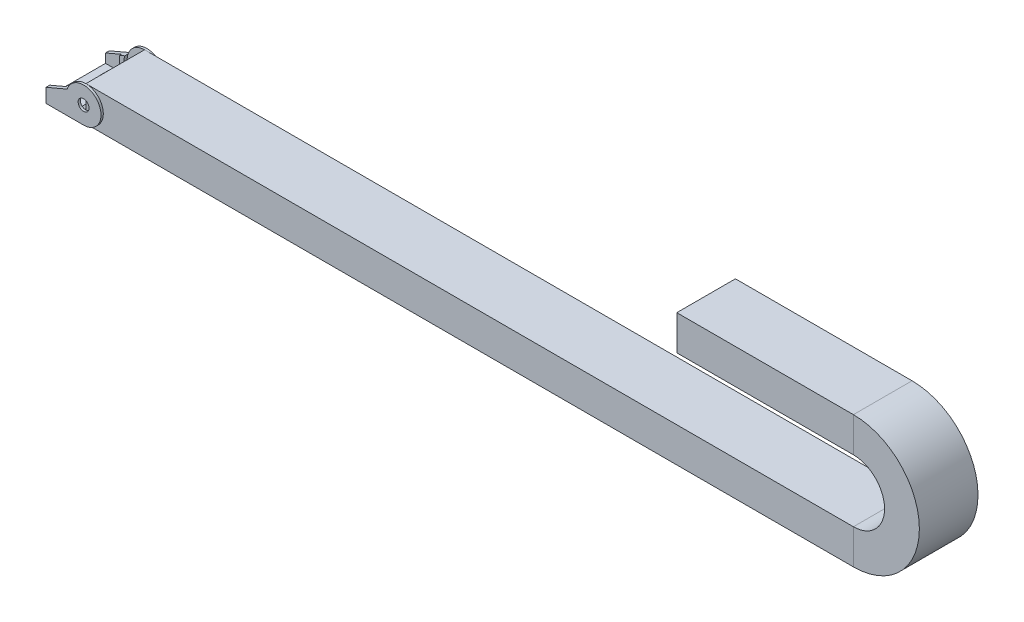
ISO-10303-21;
HEADER;
FILE_DESCRIPTION(('STEP AP214'),'2;1');
FILE_NAME('part.step','',(''),(''),'','','');
FILE_SCHEMA(('AUTOMOTIVE_DESIGN { 1 0 10303 214 1 1 1 1 }'));
ENDSEC;
DATA;
#1=APPLICATION_CONTEXT('core data for automotive mechanical design processes');
#2=APPLICATION_PROTOCOL_DEFINITION('international standard','automotive_design',2000,#1);
#3=PRODUCT_CONTEXT('',#1,'mechanical');
#4=PRODUCT('Part','Part','',(#3));
#5=PRODUCT_RELATED_PRODUCT_CATEGORY('part','',(#4));
#6=PRODUCT_DEFINITION_FORMATION('','',#4);
#7=PRODUCT_DEFINITION_CONTEXT('part definition',#1,'design');
#8=PRODUCT_DEFINITION('design','',#6,#7);
#9=PRODUCT_DEFINITION_SHAPE('','',#8);
#10=(LENGTH_UNIT() NAMED_UNIT(*) SI_UNIT(.MILLI.,.METRE.));
#11=(NAMED_UNIT(*) PLANE_ANGLE_UNIT() SI_UNIT($,.RADIAN.));
#12=(NAMED_UNIT(*) SI_UNIT($,.STERADIAN.) SOLID_ANGLE_UNIT());
#13=UNCERTAINTY_MEASURE_WITH_UNIT(LENGTH_MEASURE(1.E-05),#10,'distance_accuracy_value','');
#14=(GEOMETRIC_REPRESENTATION_CONTEXT(3) GLOBAL_UNCERTAINTY_ASSIGNED_CONTEXT((#13)) GLOBAL_UNIT_ASSIGNED_CONTEXT((#10,
#11,#12)) REPRESENTATION_CONTEXT('',''));
#15=CARTESIAN_POINT('',(0.,0.,0.));
#16=DIRECTION('',(0.,0.,1.));
#17=DIRECTION('',(1.,0.,0.));
#18=AXIS2_PLACEMENT_3D('',#15,#16,#17);
#19=CARTESIAN_POINT('',(0.,0.,42.164));
#20=DIRECTION('',(0.,0.,1.));
#21=DIRECTION('',(1.,0.,0.));
#22=AXIS2_PLACEMENT_3D('',#19,#20,#21);
#23=PLANE('',#22);
#24=DIRECTION('',(0.,-1.,0.));
#25=VECTOR('',#24,1.);
#26=CARTESIAN_POINT('',(-76.2,25.019,42.164));
#27=LINE('',#26,#25);
#28=CARTESIAN_POINT('',(-76.2,-7.874,42.164));
#29=VERTEX_POINT('',#28);
#30=CARTESIAN_POINT('',(-76.2,-25.019,42.164));
#31=VERTEX_POINT('',#30);
#32=EDGE_CURVE('E368',#29,#31,#27,.T.);
#33=ORIENTED_EDGE('',*,*,#32,.T.);
#34=DIRECTION('',(1.,0.,0.));
#35=VECTOR('',#34,1.);
#36=CARTESIAN_POINT('',(-86.6480176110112,-25.019,42.164));
#37=LINE('',#36,#35);
#38=CARTESIAN_POINT('',(-86.6480176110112,-25.019,42.164));
#39=VERTEX_POINT('',#38);
#40=EDGE_CURVE('E440',#39,#31,#37,.T.);
#41=ORIENTED_EDGE('',*,*,#40,.F.);
#42=DIRECTION('',(0.,-1.,0.));
#43=VECTOR('',#42,1.);
#44=CARTESIAN_POINT('',(-86.6480176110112,-22.733,42.164));
#45=LINE('',#44,#43);
#46=CARTESIAN_POINT('',(-86.6480176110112,-22.733,42.164));
#47=VERTEX_POINT('',#46);
#48=EDGE_CURVE('E444',#47,#39,#45,.T.);
#49=ORIENTED_EDGE('',*,*,#48,.F.);
#50=CARTESIAN_POINT('',(-76.2,0.,42.164));
#51=DIRECTION('',(0.,0.,1.));
#52=DIRECTION('',(1.,0.,0.));
#53=AXIS2_PLACEMENT_3D('',#50,#51,#52);
#54=CIRCLE('',#53,25.019);
#55=CARTESIAN_POINT('',(-99.9051547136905,8.001,42.164));
#56=VERTEX_POINT('',#55);
#57=EDGE_CURVE('E449',#56,#47,#54,.T.);
#58=ORIENTED_EDGE('',*,*,#57,.F.);
#59=CARTESIAN_POINT('',(-76.2,25.019,42.164));
#60=VERTEX_POINT('',#59);
#61=EDGE_CURVE('E51',#60,#56,#54,.T.);
#62=ORIENTED_EDGE('',*,*,#61,.F.);
#63=CARTESIAN_POINT('',(-76.2,7.874,42.164));
#64=VERTEX_POINT('',#63);
#65=EDGE_CURVE('E364',#60,#64,#27,.T.);
#66=ORIENTED_EDGE('',*,*,#65,.T.);
#67=CARTESIAN_POINT('',(-76.2,0.,42.164));
#68=DIRECTION('',(0.,0.,1.));
#69=DIRECTION('',(1.,0.,0.));
#70=AXIS2_PLACEMENT_3D('',#67,#68,#69);
#71=CIRCLE('',#70,7.874);
#72=EDGE_CURVE('E425',#64,#29,#71,.T.);
#73=ORIENTED_EDGE('',*,*,#72,.T.);
#74=EDGE_LOOP('',(#33,#41,#49,#58,#62,#66,#73));
#75=FACE_BOUND('',#74,.T.);
#76=ADVANCED_FACE('F35',(#75),#23,.F.);
#77=CARTESIAN_POINT('',(0.,0.,-42.164));
#78=DIRECTION('',(0.,0.,-1.));
#79=DIRECTION('',(1.,0.,0.));
#80=AXIS2_PLACEMENT_3D('',#77,#78,#79);
#81=PLANE('',#80);
#82=DIRECTION('',(0.,1.,0.));
#83=VECTOR('',#82,1.);
#84=CARTESIAN_POINT('',(-76.2,25.019,-42.164));
#85=LINE('',#84,#83);
#86=CARTESIAN_POINT('',(-76.2,7.874,-42.164));
#87=VERTEX_POINT('',#86);
#88=CARTESIAN_POINT('',(-76.2,25.019,-42.164));
#89=VERTEX_POINT('',#88);
#90=EDGE_CURVE('E59',#87,#89,#85,.T.);
#91=ORIENTED_EDGE('',*,*,#90,.T.);
#92=CARTESIAN_POINT('',(-76.2,0.,-42.164));
#93=DIRECTION('',(0.,0.,-1.));
#94=DIRECTION('',(-1.,0.,0.));
#95=AXIS2_PLACEMENT_3D('',#92,#93,#94);
#96=CIRCLE('',#95,25.019);
#97=CARTESIAN_POINT('',(-99.9051547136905,8.001,-42.164));
#98=VERTEX_POINT('',#97);
#99=EDGE_CURVE('E437',#89,#98,#96,.F.);
#100=ORIENTED_EDGE('',*,*,#99,.T.);
#101=CARTESIAN_POINT('',(-86.6480176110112,-22.733,-42.164));
#102=VERTEX_POINT('',#101);
#103=EDGE_CURVE('E438',#98,#102,#96,.F.);
#104=ORIENTED_EDGE('',*,*,#103,.T.);
#105=DIRECTION('',(0.,-1.,0.));
#106=VECTOR('',#105,1.);
#107=CARTESIAN_POINT('',(-86.6480176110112,-22.733,-42.164));
#108=LINE('',#107,#106);
#109=CARTESIAN_POINT('',(-86.6480176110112,-25.019,-42.164));
#110=VERTEX_POINT('',#109);
#111=EDGE_CURVE('E428',#102,#110,#108,.T.);
#112=ORIENTED_EDGE('',*,*,#111,.T.);
#113=DIRECTION('',(1.,0.,0.));
#114=VECTOR('',#113,1.);
#115=CARTESIAN_POINT('',(-86.6480176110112,-25.019,-42.164));
#116=LINE('',#115,#114);
#117=CARTESIAN_POINT('',(-76.2,-25.019,-42.164));
#118=VERTEX_POINT('',#117);
#119=EDGE_CURVE('E432',#110,#118,#116,.T.);
#120=ORIENTED_EDGE('',*,*,#119,.T.);
#121=CARTESIAN_POINT('',(-76.2,-7.874,-42.164));
#122=VERTEX_POINT('',#121);
#123=EDGE_CURVE('E405',#118,#122,#85,.T.);
#124=ORIENTED_EDGE('',*,*,#123,.T.);
#125=CARTESIAN_POINT('',(-76.2,0.,-42.164));
#126=DIRECTION('',(0.,0.,-1.));
#127=DIRECTION('',(-1.,0.,0.));
#128=AXIS2_PLACEMENT_3D('',#125,#126,#127);
#129=CIRCLE('',#128,7.874);
#130=EDGE_CURVE('E422',#122,#87,#129,.T.);
#131=ORIENTED_EDGE('',*,*,#130,.T.);
#132=EDGE_LOOP('',(#91,#100,#104,#112,#120,#124,#131));
#133=FACE_BOUND('',#132,.T.);
#134=ADVANCED_FACE('F735',(#133),#81,.F.);
#135=CARTESIAN_POINT('',(-107.188,-17.907,77.9358962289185));
#136=DIRECTION('',(0.,1.,0.));
#137=DIRECTION('',(0.,0.,1.));
#138=AXIS2_PLACEMENT_3D('',#135,#136,#137);
#139=PLANE('',#138);
#140=DIRECTION('',(0.,0.,-1.));
#141=VECTOR('',#140,1.);
#142=CARTESIAN_POINT('',(-107.188,-17.907,33.274));
#143=LINE('',#142,#141);
#144=CARTESIAN_POINT('',(-107.188,-17.907,33.274));
#145=VERTEX_POINT('',#144);
#146=CARTESIAN_POINT('',(-107.188,-17.907,21.844));
#147=VERTEX_POINT('',#146);
#148=EDGE_CURVE('E523',#145,#147,#143,.T.);
#149=ORIENTED_EDGE('',*,*,#148,.F.);
#150=CARTESIAN_POINT('',(-113.284,-17.907,33.274));
#151=DIRECTION('',(0.,-1.,0.));
#152=DIRECTION('',(0.,0.,1.));
#153=AXIS2_PLACEMENT_3D('',#150,#151,#152);
#154=CIRCLE('',#153,6.09600000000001);
#155=CARTESIAN_POINT('',(-119.38,-17.907,33.274));
#156=VERTEX_POINT('',#155);
#157=EDGE_CURVE('E532',#156,#145,#154,.F.);
#158=ORIENTED_EDGE('',*,*,#157,.F.);
#159=DIRECTION('',(0.,0.,1.));
#160=VECTOR('',#159,1.);
#161=CARTESIAN_POINT('',(-119.38,-17.907,21.844));
#162=LINE('',#161,#160);
#163=CARTESIAN_POINT('',(-119.38,-17.907,21.844));
#164=VERTEX_POINT('',#163);
#165=EDGE_CURVE('E537',#164,#156,#162,.T.);
#166=ORIENTED_EDGE('',*,*,#165,.F.);
#167=CARTESIAN_POINT('',(-113.284,-17.907,21.844));
#168=DIRECTION('',(0.,-1.,0.));
#169=DIRECTION('',(0.,0.,1.));
#170=AXIS2_PLACEMENT_3D('',#167,#168,#169);
#171=CIRCLE('',#170,6.09600000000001);
#172=EDGE_CURVE('E541',#147,#164,#171,.F.);
#173=ORIENTED_EDGE('',*,*,#172,.F.);
#174=EDGE_LOOP('',(#149,#158,#166,#173));
#175=FACE_BOUND('',#174,.T.);
#176=DIRECTION('',(0.,0.,-1.));
#177=VECTOR('',#176,1.);
#178=CARTESIAN_POINT('',(-107.188,-17.907,-33.274));
#179=LINE('',#178,#177);
#180=CARTESIAN_POINT('',(-107.188,-17.907,-33.274));
#181=VERTEX_POINT('',#180);
#182=CARTESIAN_POINT('',(-107.188,-17.907,-21.844));
#183=VERTEX_POINT('',#182);
#184=EDGE_CURVE('E481',#181,#183,#179,.F.);
#185=ORIENTED_EDGE('',*,*,#184,.T.);
#186=CARTESIAN_POINT('',(-113.284,-17.907,-21.844));
#187=DIRECTION('',(0.,-1.,0.));
#188=DIRECTION('',(0.,0.,1.));
#189=AXIS2_PLACEMENT_3D('',#186,#187,#188);
#190=CIRCLE('',#189,6.09600000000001);
#191=CARTESIAN_POINT('',(-119.38,-17.907,-21.844));
#192=VERTEX_POINT('',#191);
#193=EDGE_CURVE('E477',#183,#192,#190,.T.);
#194=ORIENTED_EDGE('',*,*,#193,.T.);
#195=DIRECTION('',(0.,0.,1.));
#196=VECTOR('',#195,1.);
#197=CARTESIAN_POINT('',(-119.38,-17.907,-21.844));
#198=LINE('',#197,#196);
#199=CARTESIAN_POINT('',(-119.38,-17.907,-33.274));
#200=VERTEX_POINT('',#199);
#201=EDGE_CURVE('E487',#192,#200,#198,.F.);
#202=ORIENTED_EDGE('',*,*,#201,.T.);
#203=CARTESIAN_POINT('',(-113.284,-17.907,-33.274));
#204=DIRECTION('',(0.,-1.,0.));
#205=DIRECTION('',(0.,0.,1.));
#206=AXIS2_PLACEMENT_3D('',#203,#204,#205);
#207=CIRCLE('',#206,6.09600000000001);
#208=EDGE_CURVE('E484',#200,#181,#207,.T.);
#209=ORIENTED_EDGE('',*,*,#208,.T.);
#210=EDGE_LOOP('',(#185,#194,#202,#209));
#211=FACE_BOUND('',#210,.T.);
#212=DIRECTION('',(-1.,0.,0.));
#213=VECTOR('',#212,1.);
#214=CARTESIAN_POINT('',(-90.424,-17.907,37.465));
#215=LINE('',#214,#213);
#216=CARTESIAN_POINT('',(-93.6725416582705,-17.907,37.465));
#217=VERTEX_POINT('',#216);
#218=CARTESIAN_POINT('',(-107.188,-17.907,37.465));
#219=VERTEX_POINT('',#218);
#220=EDGE_CURVE('E624',#217,#219,#215,.T.);
#221=ORIENTED_EDGE('',*,*,#220,.F.);
#222=DIRECTION('',(0.,0.,-1.));
#223=VECTOR('',#222,1.);
#224=CARTESIAN_POINT('',(-93.6725416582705,-17.907,112.928418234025));
#225=LINE('',#224,#223);
#226=CARTESIAN_POINT('',(-93.6725416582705,-17.907,-37.4649999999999));
#227=VERTEX_POINT('',#226);
#228=EDGE_CURVE('E443',#217,#227,#225,.T.);
#229=ORIENTED_EDGE('',*,*,#228,.T.);
#230=DIRECTION('',(-1.,0.,0.));
#231=VECTOR('',#230,1.);
#232=CARTESIAN_POINT('',(-90.424,-17.907,-37.465));
#233=LINE('',#232,#231);
#234=CARTESIAN_POINT('',(-107.188,-17.907,-37.465));
#235=VERTEX_POINT('',#234);
#236=EDGE_CURVE('E614',#227,#235,#233,.T.);
#237=ORIENTED_EDGE('',*,*,#236,.T.);
#238=DIRECTION('',(0.,0.,-1.));
#239=VECTOR('',#238,1.);
#240=CARTESIAN_POINT('',(-107.188,-17.907,77.9358962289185));
#241=LINE('',#240,#239);
#242=CARTESIAN_POINT('',(-107.188,-17.907,-40.132));
#243=VERTEX_POINT('',#242);
#244=EDGE_CURVE('E663',#235,#243,#241,.T.);
#245=ORIENTED_EDGE('',*,*,#244,.T.);
#246=DIRECTION('',(1.,0.,0.));
#247=VECTOR('',#246,1.);
#248=CARTESIAN_POINT('',(-107.188,-17.907,-40.132));
#249=LINE('',#248,#247);
#250=CARTESIAN_POINT('',(-130.302,-17.907,-40.132));
#251=VERTEX_POINT('',#250);
#252=EDGE_CURVE('E636',#251,#243,#249,.T.);
#253=ORIENTED_EDGE('',*,*,#252,.F.);
#254=DIRECTION('',(0.,0.,-1.));
#255=VECTOR('',#254,1.);
#256=CARTESIAN_POINT('',(-130.302,-17.907,77.9358962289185));
#257=LINE('',#256,#255);
#258=CARTESIAN_POINT('',(-130.302,-17.907,40.132));
#259=VERTEX_POINT('',#258);
#260=EDGE_CURVE('E659',#259,#251,#257,.T.);
#261=ORIENTED_EDGE('',*,*,#260,.F.);
#262=DIRECTION('',(-1.,0.,0.));
#263=VECTOR('',#262,1.);
#264=CARTESIAN_POINT('',(-107.188,-17.907,40.132));
#265=LINE('',#264,#263);
#266=CARTESIAN_POINT('',(-107.188,-17.907,40.132));
#267=VERTEX_POINT('',#266);
#268=EDGE_CURVE('E647',#267,#259,#265,.T.);
#269=ORIENTED_EDGE('',*,*,#268,.F.);
#270=EDGE_CURVE('E664',#267,#219,#241,.T.);
#271=ORIENTED_EDGE('',*,*,#270,.T.);
#272=EDGE_LOOP('',(#221,#229,#237,#245,#253,#261,#269,#271));
#273=FACE_BOUND('',#272,.T.);
#274=ADVANCED_FACE('F802',(#175,#211,#273),#139,.T.);
#275=CARTESIAN_POINT('',(-76.2,-25.019,45.466));
#276=DIRECTION('',(0.,1.,0.));
#277=DIRECTION('',(0.,0.,1.));
#278=AXIS2_PLACEMENT_3D('',#275,#276,#277);
#279=PLANE('',#278);
#280=DIRECTION('',(0.,0.,-1.));
#281=VECTOR('',#280,1.);
#282=CARTESIAN_POINT('',(-110.236,-25.019,33.274));
#283=LINE('',#282,#281);
#284=CARTESIAN_POINT('',(-110.236,-25.019,33.274));
#285=VERTEX_POINT('',#284);
#286=CARTESIAN_POINT('',(-110.236,-25.019,21.844));
#287=VERTEX_POINT('',#286);
#288=EDGE_CURVE('E565',#285,#287,#283,.T.);
#289=ORIENTED_EDGE('',*,*,#288,.T.);
#290=CARTESIAN_POINT('',(-113.284,-25.019,21.844));
#291=DIRECTION('',(0.,1.,0.));
#292=DIRECTION('',(0.,0.,-1.));
#293=AXIS2_PLACEMENT_3D('',#290,#291,#292);
#294=CIRCLE('',#293,3.048);
#295=CARTESIAN_POINT('',(-116.332,-25.019,21.844));
#296=VERTEX_POINT('',#295);
#297=EDGE_CURVE('E568',#287,#296,#294,.T.);
#298=ORIENTED_EDGE('',*,*,#297,.T.);
#299=DIRECTION('',(0.,0.,1.));
#300=VECTOR('',#299,1.);
#301=CARTESIAN_POINT('',(-116.332,-25.019,33.274));
#302=LINE('',#301,#300);
#303=CARTESIAN_POINT('',(-116.332,-25.019,33.274));
#304=VERTEX_POINT('',#303);
#305=EDGE_CURVE('E553',#296,#304,#302,.T.);
#306=ORIENTED_EDGE('',*,*,#305,.T.);
#307=CARTESIAN_POINT('',(-113.284,-25.019,33.274));
#308=DIRECTION('',(0.,1.,0.));
#309=DIRECTION('',(0.,0.,-1.));
#310=AXIS2_PLACEMENT_3D('',#307,#308,#309);
#311=CIRCLE('',#310,3.048);
#312=EDGE_CURVE('E548',#304,#285,#311,.T.);
#313=ORIENTED_EDGE('',*,*,#312,.T.);
#314=EDGE_LOOP('',(#289,#298,#306,#313));
#315=FACE_BOUND('',#314,.T.);
#316=CARTESIAN_POINT('',(-113.284,-25.019,-33.274));
#317=DIRECTION('',(0.,-1.,0.));
#318=DIRECTION('',(0.,0.,1.));
#319=AXIS2_PLACEMENT_3D('',#316,#317,#318);
#320=CIRCLE('',#319,3.048);
#321=CARTESIAN_POINT('',(-116.332,-25.019,-33.274));
#322=VERTEX_POINT('',#321);
#323=CARTESIAN_POINT('',(-110.236,-25.019,-33.274));
#324=VERTEX_POINT('',#323);
#325=EDGE_CURVE('E480',#322,#324,#320,.T.);
#326=ORIENTED_EDGE('',*,*,#325,.F.);
#327=DIRECTION('',(0.,0.,-1.));
#328=VECTOR('',#327,1.);
#329=CARTESIAN_POINT('',(-116.332,-25.019,-33.274));
#330=LINE('',#329,#328);
#331=CARTESIAN_POINT('',(-116.332,-25.019,-21.844));
#332=VERTEX_POINT('',#331);
#333=EDGE_CURVE('E513',#332,#322,#330,.T.);
#334=ORIENTED_EDGE('',*,*,#333,.F.);
#335=CARTESIAN_POINT('',(-113.284,-25.019,-21.844));
#336=DIRECTION('',(0.,-1.,0.));
#337=DIRECTION('',(0.,0.,1.));
#338=AXIS2_PLACEMENT_3D('',#335,#336,#337);
#339=CIRCLE('',#338,3.048);
#340=CARTESIAN_POINT('',(-110.236,-25.019,-21.844));
#341=VERTEX_POINT('',#340);
#342=EDGE_CURVE('E516',#341,#332,#339,.T.);
#343=ORIENTED_EDGE('',*,*,#342,.F.);
#344=DIRECTION('',(0.,0.,1.));
#345=VECTOR('',#344,1.);
#346=CARTESIAN_POINT('',(-110.236,-25.019,-33.274));
#347=LINE('',#346,#345);
#348=EDGE_CURVE('E501',#324,#341,#347,.T.);
#349=ORIENTED_EDGE('',*,*,#348,.F.);
#350=EDGE_LOOP('',(#326,#334,#343,#349));
#351=FACE_BOUND('',#350,.T.);
#352=DIRECTION('',(0.,0.,-1.));
#353=VECTOR('',#352,1.);
#354=CARTESIAN_POINT('',(-86.6480176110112,-25.019,112.928418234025));
#355=LINE('',#354,#353);
#356=CARTESIAN_POINT('',(-86.6480176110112,-25.019,37.465));
#357=VERTEX_POINT('',#356);
#358=EDGE_CURVE('E454',#39,#357,#355,.T.);
#359=ORIENTED_EDGE('',*,*,#358,.F.);
#360=ORIENTED_EDGE('',*,*,#40,.T.);
#361=DIRECTION('',(0.,0.,-1.));
#362=VECTOR('',#361,1.);
#363=CARTESIAN_POINT('',(-76.2,-25.019,45.466));
#364=LINE('',#363,#362);
#365=CARTESIAN_POINT('',(-76.2,-25.019,45.466));
#366=VERTEX_POINT('',#365);
#367=EDGE_CURVE('E700',#366,#31,#364,.T.);
#368=ORIENTED_EDGE('',*,*,#367,.F.);
#369=DIRECTION('',(-1.,0.,0.));
#370=VECTOR('',#369,1.);
#371=CARTESIAN_POINT('',(-76.2,-25.019,45.466));
#372=LINE('',#371,#370);
#373=CARTESIAN_POINT('',(-130.302,-25.019,45.466));
#374=VERTEX_POINT('',#373);
#375=EDGE_CURVE('E669',#366,#374,#372,.T.);
#376=ORIENTED_EDGE('',*,*,#375,.T.);
#377=DIRECTION('',(0.,0.,-1.));
#378=VECTOR('',#377,1.);
#379=CARTESIAN_POINT('',(-130.302,-25.019,45.466));
#380=LINE('',#379,#378);
#381=CARTESIAN_POINT('',(-130.302,-25.019,40.132));
#382=VERTEX_POINT('',#381);
#383=EDGE_CURVE('E696',#374,#382,#380,.T.);
#384=ORIENTED_EDGE('',*,*,#383,.T.);
#385=DIRECTION('',(1.,0.,0.));
#386=VECTOR('',#385,1.);
#387=CARTESIAN_POINT('',(-120.396,-25.019,40.132));
#388=LINE('',#387,#386);
#389=CARTESIAN_POINT('',(-120.396,-25.019,40.132));
#390=VERTEX_POINT('',#389);
#391=EDGE_CURVE('E585',#382,#390,#388,.T.);
#392=ORIENTED_EDGE('',*,*,#391,.T.);
#393=DIRECTION('',(0.,0.,-1.));
#394=VECTOR('',#393,1.);
#395=CARTESIAN_POINT('',(-120.396,-25.019,-40.132));
#396=LINE('',#395,#394);
#397=CARTESIAN_POINT('',(-120.396,-25.019,-40.132));
#398=VERTEX_POINT('',#397);
#399=EDGE_CURVE('E575',#390,#398,#396,.T.);
#400=ORIENTED_EDGE('',*,*,#399,.T.);
#401=DIRECTION('',(-1.,0.,0.));
#402=VECTOR('',#401,1.);
#403=CARTESIAN_POINT('',(-120.396,-25.019,-40.132));
#404=LINE('',#403,#402);
#405=CARTESIAN_POINT('',(-130.302,-25.019,-40.132));
#406=VERTEX_POINT('',#405);
#407=EDGE_CURVE('E595',#398,#406,#404,.T.);
#408=ORIENTED_EDGE('',*,*,#407,.T.);
#409=CARTESIAN_POINT('',(-130.302,-25.019,-45.466));
#410=VERTEX_POINT('',#409);
#411=EDGE_CURVE('E695',#406,#410,#380,.T.);
#412=ORIENTED_EDGE('',*,*,#411,.T.);
#413=DIRECTION('',(-1.,0.,0.));
#414=VECTOR('',#413,1.);
#415=CARTESIAN_POINT('',(-76.2,-25.019,-45.466));
#416=LINE('',#415,#414);
#417=CARTESIAN_POINT('',(-76.2,-25.019,-45.466));
#418=VERTEX_POINT('',#417);
#419=EDGE_CURVE('E650',#418,#410,#416,.T.);
#420=ORIENTED_EDGE('',*,*,#419,.F.);
#421=EDGE_CURVE('E699',#118,#418,#364,.T.);
#422=ORIENTED_EDGE('',*,*,#421,.F.);
#423=ORIENTED_EDGE('',*,*,#119,.F.);
#424=CARTESIAN_POINT('',(-86.6480176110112,-25.019,-37.4649999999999));
#425=VERTEX_POINT('',#424);
#426=EDGE_CURVE('E453',#425,#110,#355,.T.);
#427=ORIENTED_EDGE('',*,*,#426,.F.);
#428=DIRECTION('',(-1.,0.,0.));
#429=VECTOR('',#428,1.);
#430=CARTESIAN_POINT('',(-76.2,-25.019,-37.465));
#431=LINE('',#430,#429);
#432=CARTESIAN_POINT('',(-90.424,-25.019,-37.465));
#433=VERTEX_POINT('',#432);
#434=EDGE_CURVE('E608',#425,#433,#431,.T.);
#435=ORIENTED_EDGE('',*,*,#434,.T.);
#436=DIRECTION('',(0.,0.,1.));
#437=VECTOR('',#436,1.);
#438=CARTESIAN_POINT('',(-90.424,-25.019,-37.465));
#439=LINE('',#438,#437);
#440=CARTESIAN_POINT('',(-90.424,-25.019,37.465));
#441=VERTEX_POINT('',#440);
#442=EDGE_CURVE('E619',#433,#441,#439,.T.);
#443=ORIENTED_EDGE('',*,*,#442,.T.);
#444=DIRECTION('',(-1.,0.,0.));
#445=VECTOR('',#444,1.);
#446=CARTESIAN_POINT('',(-76.2,-25.019,37.465));
#447=LINE('',#446,#445);
#448=EDGE_CURVE('E602',#357,#441,#447,.T.);
#449=ORIENTED_EDGE('',*,*,#448,.F.);
#450=EDGE_LOOP('',(#359,#360,#368,#376,#384,#392,#400,#408,#412,#420,#422,#423,#427,#435,#443,#449));
#451=FACE_BOUND('',#450,.T.);
#452=ADVANCED_FACE('F723',(#315,#351,#451),#279,.F.);
#453=CARTESIAN_POINT('',(-90.424,-25.019,-37.465));
#454=DIRECTION('',(-1.,0.,0.));
#455=DIRECTION('',(0.,0.,-1.));
#456=AXIS2_PLACEMENT_3D('',#453,#454,#455);
#457=PLANE('',#456);
#458=DIRECTION('',(0.,0.,-1.));
#459=VECTOR('',#458,1.);
#460=CARTESIAN_POINT('',(-90.424,-20.5822298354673,112.928418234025));
#461=LINE('',#460,#459);
#462=CARTESIAN_POINT('',(-90.424,-20.5822298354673,37.465));
#463=VERTEX_POINT('',#462);
#464=CARTESIAN_POINT('',(-90.424,-20.5822298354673,-37.465));
#465=VERTEX_POINT('',#464);
#466=EDGE_CURVE('E461',#463,#465,#461,.T.);
#467=ORIENTED_EDGE('',*,*,#466,.F.);
#468=DIRECTION('',(0.,1.,0.));
#469=VECTOR('',#468,1.);
#470=CARTESIAN_POINT('',(-90.424,-25.019,37.465));
#471=LINE('',#470,#469);
#472=EDGE_CURVE('E621',#441,#463,#471,.T.);
#473=ORIENTED_EDGE('',*,*,#472,.F.);
#474=ORIENTED_EDGE('',*,*,#442,.F.);
#475=DIRECTION('',(0.,1.,0.));
#476=VECTOR('',#475,1.);
#477=CARTESIAN_POINT('',(-90.424,-25.019,-37.465));
#478=LINE('',#477,#476);
#479=EDGE_CURVE('E610',#433,#465,#478,.T.);
#480=ORIENTED_EDGE('',*,*,#479,.T.);
#481=EDGE_LOOP('',(#467,#473,#474,#480));
#482=FACE_BOUND('',#481,.T.);
#483=ADVANCED_FACE('F716',(#482),#457,.F.);
#484=CARTESIAN_POINT('',(-76.2,0.,-37.465));
#485=DIRECTION('',(0.,0.,1.));
#486=DIRECTION('',(-1.,0.,0.));
#487=AXIS2_PLACEMENT_3D('',#484,#485,#486);
#488=PLANE('',#487);
#489=ORIENTED_EDGE('',*,*,#434,.F.);
#490=DIRECTION('',(0.,1.,0.));
#491=VECTOR('',#490,1.);
#492=CARTESIAN_POINT('',(-86.6480176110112,0.,-37.465));
#493=LINE('',#492,#491);
#494=CARTESIAN_POINT('',(-86.6480176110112,-22.733,-37.4649999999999));
#495=VERTEX_POINT('',#494);
#496=EDGE_CURVE('E467',#425,#495,#493,.T.);
#497=ORIENTED_EDGE('',*,*,#496,.T.);
#498=CARTESIAN_POINT('',(-76.2,0.,-37.465));
#499=DIRECTION('',(0.,0.,1.));
#500=DIRECTION('',(1.,0.,0.));
#501=AXIS2_PLACEMENT_3D('',#498,#499,#500);
#502=CIRCLE('',#501,25.019);
#503=EDGE_CURVE('E462',#495,#465,#502,.F.);
#504=ORIENTED_EDGE('',*,*,#503,.T.);
#505=ORIENTED_EDGE('',*,*,#479,.F.);
#506=EDGE_LOOP('',(#489,#497,#504,#505));
#507=FACE_BOUND('',#506,.T.);
#508=ADVANCED_FACE('F728',(#507),#488,.T.);
#509=ORIENTED_EDGE('',*,*,#236,.F.);
#510=CARTESIAN_POINT('',(-99.9051547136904,8.001,-37.465));
#511=VERTEX_POINT('',#510);
#512=EDGE_CURVE('E458',#227,#511,#502,.F.);
#513=ORIENTED_EDGE('',*,*,#512,.T.);
#514=DIRECTION('',(0.919945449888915,0.392046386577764,0.));
#515=VECTOR('',#514,1.);
#516=CARTESIAN_POINT('',(-130.302,-4.953,-37.465));
#517=LINE('',#516,#515);
#518=CARTESIAN_POINT('',(-107.188,4.89732338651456,-37.465));
#519=VERTEX_POINT('',#518);
#520=EDGE_CURVE('E616',#519,#511,#517,.T.);
#521=ORIENTED_EDGE('',*,*,#520,.F.);
#522=DIRECTION('',(0.,-1.,0.));
#523=VECTOR('',#522,1.);
#524=CARTESIAN_POINT('',(-107.188,4.89732338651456,-37.465));
#525=LINE('',#524,#523);
#526=EDGE_CURVE('E633',#519,#235,#525,.T.);
#527=ORIENTED_EDGE('',*,*,#526,.T.);
#528=EDGE_LOOP('',(#509,#513,#521,#527));
#529=FACE_BOUND('',#528,.T.);
#530=ADVANCED_FACE('F891',(#529),#488,.T.);
#531=CARTESIAN_POINT('',(-76.2,0.,37.465));
#532=DIRECTION('',(0.,0.,1.));
#533=DIRECTION('',(-1.,0.,0.));
#534=AXIS2_PLACEMENT_3D('',#531,#532,#533);
#535=PLANE('',#534);
#536=DIRECTION('',(0.,1.,0.));
#537=VECTOR('',#536,1.);
#538=CARTESIAN_POINT('',(-86.6480176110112,0.,37.465));
#539=LINE('',#538,#537);
#540=CARTESIAN_POINT('',(-86.6480176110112,-22.733,37.465));
#541=VERTEX_POINT('',#540);
#542=EDGE_CURVE('E12',#357,#541,#539,.T.);
#543=ORIENTED_EDGE('',*,*,#542,.F.);
#544=ORIENTED_EDGE('',*,*,#448,.T.);
#545=ORIENTED_EDGE('',*,*,#472,.T.);
#546=CARTESIAN_POINT('',(-76.2,0.,37.465));
#547=DIRECTION('',(0.,0.,1.));
#548=DIRECTION('',(1.,0.,0.));
#549=AXIS2_PLACEMENT_3D('',#546,#547,#548);
#550=CIRCLE('',#549,25.019);
#551=EDGE_CURVE('E44',#541,#463,#550,.F.);
#552=ORIENTED_EDGE('',*,*,#551,.F.);
#553=EDGE_LOOP('',(#543,#544,#545,#552));
#554=FACE_BOUND('',#553,.T.);
#555=ADVANCED_FACE('F719',(#554),#535,.F.);
#556=CARTESIAN_POINT('',(-99.9051547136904,8.001,37.465));
#557=VERTEX_POINT('',#556);
#558=EDGE_CURVE('E703',#217,#557,#550,.F.);
#559=ORIENTED_EDGE('',*,*,#558,.F.);
#560=ORIENTED_EDGE('',*,*,#220,.T.);
#561=DIRECTION('',(0.,-1.,0.));
#562=VECTOR('',#561,1.);
#563=CARTESIAN_POINT('',(-107.188,4.89732338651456,37.465));
#564=LINE('',#563,#562);
#565=CARTESIAN_POINT('',(-107.188,4.89732338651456,37.465));
#566=VERTEX_POINT('',#565);
#567=EDGE_CURVE('E630',#566,#219,#564,.T.);
#568=ORIENTED_EDGE('',*,*,#567,.F.);
#569=DIRECTION('',(0.919945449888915,0.392046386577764,0.));
#570=VECTOR('',#569,1.);
#571=CARTESIAN_POINT('',(-130.302,-4.953,37.465));
#572=LINE('',#571,#570);
#573=EDGE_CURVE('E611',#566,#557,#572,.T.);
#574=ORIENTED_EDGE('',*,*,#573,.T.);
#575=EDGE_LOOP('',(#559,#560,#568,#574));
#576=FACE_BOUND('',#575,.T.);
#577=ADVANCED_FACE('F894',(#576),#535,.F.);
#578=CARTESIAN_POINT('',(-76.2,0.,45.466));
#579=DIRECTION('',(0.,0.,-1.));
#580=DIRECTION('',(1.,0.,0.));
#581=AXIS2_PLACEMENT_3D('',#578,#579,#580);
#582=CYLINDRICAL_SURFACE('',#581,25.019);
#583=DIRECTION('',(0.,0.,-1.));
#584=VECTOR('',#583,1.);
#585=CARTESIAN_POINT('',(-99.9051547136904,8.001,45.466));
#586=LINE('',#585,#584);
#587=CARTESIAN_POINT('',(-99.9051547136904,8.001,-45.466));
#588=VERTEX_POINT('',#587);
#589=EDGE_CURVE('E679',#98,#588,#586,.T.);
#590=ORIENTED_EDGE('',*,*,#589,.F.);
#591=ORIENTED_EDGE('',*,*,#99,.F.);
#592=EDGE_CURVE('E433',#118,#89,#96,.F.);
#593=ORIENTED_EDGE('',*,*,#592,.F.);
#594=ORIENTED_EDGE('',*,*,#421,.T.);
#595=CARTESIAN_POINT('',(-76.2,0.,-45.466));
#596=DIRECTION('',(0.,0.,1.));
#597=DIRECTION('',(1.,0.,0.));
#598=AXIS2_PLACEMENT_3D('',#595,#596,#597);
#599=CIRCLE('',#598,25.019);
#600=EDGE_CURVE('E470',#418,#588,#599,.T.);
#601=ORIENTED_EDGE('',*,*,#600,.T.);
#602=EDGE_LOOP('',(#590,#591,#593,#594,#601));
#603=FACE_BOUND('',#602,.T.);
#604=ADVANCED_FACE('F1160',(#603),#582,.T.);
#605=ORIENTED_EDGE('',*,*,#367,.T.);
#606=EDGE_CURVE('E447',#31,#60,#54,.T.);
#607=ORIENTED_EDGE('',*,*,#606,.T.);
#608=ORIENTED_EDGE('',*,*,#61,.T.);
#609=CARTESIAN_POINT('',(-99.9051547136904,8.001,45.466));
#610=VERTEX_POINT('',#609);
#611=EDGE_CURVE('E687',#610,#56,#586,.T.);
#612=ORIENTED_EDGE('',*,*,#611,.F.);
#613=CARTESIAN_POINT('',(-76.2,0.,45.466));
#614=DIRECTION('',(0.,0.,1.));
#615=DIRECTION('',(1.,0.,0.));
#616=AXIS2_PLACEMENT_3D('',#613,#614,#615);
#617=CIRCLE('',#616,25.019);
#618=EDGE_CURVE('E473',#366,#610,#617,.T.);
#619=ORIENTED_EDGE('',*,*,#618,.F.);
#620=EDGE_LOOP('',(#605,#607,#608,#612,#619));
#621=FACE_BOUND('',#620,.T.);
#622=ADVANCED_FACE('F37',(#621),#582,.T.);
#623=CARTESIAN_POINT('',(-130.302,-4.953,45.466));
#624=DIRECTION('',(0.392046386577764,-0.919945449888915,0.));
#625=DIRECTION('',(-0.919945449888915,-0.392046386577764,0.));
#626=AXIS2_PLACEMENT_3D('',#623,#624,#625);
#627=PLANE('',#626);
#628=ORIENTED_EDGE('',*,*,#520,.T.);
#629=EDGE_CURVE('E691',#511,#98,#586,.T.);
#630=ORIENTED_EDGE('',*,*,#629,.T.);
#631=ORIENTED_EDGE('',*,*,#589,.T.);
#632=DIRECTION('',(0.919945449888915,0.392046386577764,0.));
#633=VECTOR('',#632,1.);
#634=CARTESIAN_POINT('',(-130.302,-4.953,-45.466));
#635=LINE('',#634,#633);
#636=CARTESIAN_POINT('',(-130.302,-4.953,-45.466));
#637=VERTEX_POINT('',#636);
#638=EDGE_CURVE('E673',#637,#588,#635,.T.);
#639=ORIENTED_EDGE('',*,*,#638,.F.);
#640=DIRECTION('',(0.,0.,-1.));
#641=VECTOR('',#640,1.);
#642=CARTESIAN_POINT('',(-130.302,-4.953,45.466));
#643=LINE('',#642,#641);
#644=CARTESIAN_POINT('',(-130.302,-4.953,-40.132));
#645=VERTEX_POINT('',#644);
#646=EDGE_CURVE('E690',#645,#637,#643,.T.);
#647=ORIENTED_EDGE('',*,*,#646,.F.);
#648=DIRECTION('',(-0.919945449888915,-0.392046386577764,0.));
#649=VECTOR('',#648,1.);
#650=CARTESIAN_POINT('',(-130.302,-4.953,-40.132));
#651=LINE('',#650,#649);
#652=CARTESIAN_POINT('',(-107.188,4.89732338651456,-40.132));
#653=VERTEX_POINT('',#652);
#654=EDGE_CURVE('E641',#653,#645,#651,.T.);
#655=ORIENTED_EDGE('',*,*,#654,.F.);
#656=DIRECTION('',(0.,0.,-1.));
#657=VECTOR('',#656,1.);
#658=CARTESIAN_POINT('',(-107.188,4.89732338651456,77.9358962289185));
#659=LINE('',#658,#657);
#660=EDGE_CURVE('E646',#519,#653,#659,.T.);
#661=ORIENTED_EDGE('',*,*,#660,.F.);
#662=EDGE_LOOP('',(#628,#630,#631,#639,#647,#655,#661));
#663=FACE_BOUND('',#662,.T.);
#664=ADVANCED_FACE('F925',(#663),#627,.F.);
#665=CARTESIAN_POINT('',(-107.188,4.89732338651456,77.9358962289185));
#666=DIRECTION('',(-1.,0.,0.));
#667=DIRECTION('',(0.,1.,0.));
#668=AXIS2_PLACEMENT_3D('',#665,#666,#667);
#669=PLANE('',#668);
#670=ORIENTED_EDGE('',*,*,#660,.T.);
#671=DIRECTION('',(0.,1.,0.));
#672=VECTOR('',#671,1.);
#673=CARTESIAN_POINT('',(-107.188,4.89732338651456,-40.132));
#674=LINE('',#673,#672);
#675=EDGE_CURVE('E644',#243,#653,#674,.T.);
#676=ORIENTED_EDGE('',*,*,#675,.F.);
#677=ORIENTED_EDGE('',*,*,#244,.F.);
#678=ORIENTED_EDGE('',*,*,#526,.F.);
#679=EDGE_LOOP('',(#670,#676,#677,#678));
#680=FACE_BOUND('',#679,.T.);
#681=ADVANCED_FACE('F909',(#680),#669,.T.);
#682=CARTESIAN_POINT('',(-130.302,-25.019,45.466));
#683=DIRECTION('',(1.,0.,0.));
#684=DIRECTION('',(0.,0.,1.));
#685=AXIS2_PLACEMENT_3D('',#682,#683,#684);
#686=PLANE('',#685);
#687=ORIENTED_EDGE('',*,*,#383,.F.);
#688=DIRECTION('',(0.,1.,0.));
#689=VECTOR('',#688,1.);
#690=CARTESIAN_POINT('',(-130.302,-25.019,45.466));
#691=LINE('',#690,#689);
#692=CARTESIAN_POINT('',(-130.302,-4.953,45.466));
#693=VERTEX_POINT('',#692);
#694=EDGE_CURVE('E672',#374,#693,#691,.T.);
#695=ORIENTED_EDGE('',*,*,#694,.T.);
#696=CARTESIAN_POINT('',(-130.302,-4.953,40.132));
#697=VERTEX_POINT('',#696);
#698=EDGE_CURVE('E692',#693,#697,#643,.T.);
#699=ORIENTED_EDGE('',*,*,#698,.T.);
#700=DIRECTION('',(0.,1.,0.));
#701=VECTOR('',#700,1.);
#702=CARTESIAN_POINT('',(-130.302,-17.907,40.132));
#703=LINE('',#702,#701);
#704=EDGE_CURVE('E656',#259,#697,#703,.T.);
#705=ORIENTED_EDGE('',*,*,#704,.F.);
#706=ORIENTED_EDGE('',*,*,#260,.T.);
#707=DIRECTION('',(0.,-1.,0.));
#708=VECTOR('',#707,1.);
#709=CARTESIAN_POINT('',(-130.302,-17.907,-40.132));
#710=LINE('',#709,#708);
#711=EDGE_CURVE('E639',#645,#251,#710,.T.);
#712=ORIENTED_EDGE('',*,*,#711,.F.);
#713=ORIENTED_EDGE('',*,*,#646,.T.);
#714=DIRECTION('',(0.,1.,0.));
#715=VECTOR('',#714,1.);
#716=CARTESIAN_POINT('',(-130.302,-25.019,-45.466));
#717=LINE('',#716,#715);
#718=EDGE_CURVE('E682',#410,#637,#717,.T.);
#719=ORIENTED_EDGE('',*,*,#718,.F.);
#720=ORIENTED_EDGE('',*,*,#411,.F.);
#721=DIRECTION('',(0.,-1.,0.));
#722=VECTOR('',#721,1.);
#723=CARTESIAN_POINT('',(-130.302,-22.987,-40.132));
#724=LINE('',#723,#722);
#725=CARTESIAN_POINT('',(-130.302,-22.987,-40.132));
#726=VERTEX_POINT('',#725);
#727=EDGE_CURVE('E605',#726,#406,#724,.T.);
#728=ORIENTED_EDGE('',*,*,#727,.F.);
#729=DIRECTION('',(0.,0.,1.));
#730=VECTOR('',#729,1.);
#731=CARTESIAN_POINT('',(-130.302,-22.987,-40.132));
#732=LINE('',#731,#730);
#733=CARTESIAN_POINT('',(-130.302,-22.987,40.132));
#734=VERTEX_POINT('',#733);
#735=EDGE_CURVE('E587',#726,#734,#732,.T.);
#736=ORIENTED_EDGE('',*,*,#735,.T.);
#737=DIRECTION('',(0.,-1.,0.));
#738=VECTOR('',#737,1.);
#739=CARTESIAN_POINT('',(-130.302,-22.987,40.132));
#740=LINE('',#739,#738);
#741=EDGE_CURVE('E603',#734,#382,#740,.T.);
#742=ORIENTED_EDGE('',*,*,#741,.T.);
#743=EDGE_LOOP('',(#687,#695,#699,#705,#706,#712,#713,#719,#720,#728,#736,#742));
#744=FACE_BOUND('',#743,.T.);
#745=ADVANCED_FACE('F923',(#744),#686,.F.);
#746=CARTESIAN_POINT('',(-107.188,4.89732338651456,40.132));
#747=VERTEX_POINT('',#746);
#748=EDGE_CURVE('E660',#747,#566,#659,.T.);
#749=ORIENTED_EDGE('',*,*,#748,.F.);
#750=DIRECTION('',(0.919945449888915,0.392046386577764,0.));
#751=VECTOR('',#750,1.);
#752=CARTESIAN_POINT('',(-130.302,-4.953,40.132));
#753=LINE('',#752,#751);
#754=EDGE_CURVE('E653',#697,#747,#753,.T.);
#755=ORIENTED_EDGE('',*,*,#754,.F.);
#756=ORIENTED_EDGE('',*,*,#698,.F.);
#757=DIRECTION('',(0.919945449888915,0.392046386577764,0.));
#758=VECTOR('',#757,1.);
#759=CARTESIAN_POINT('',(-130.302,-4.953,45.466));
#760=LINE('',#759,#758);
#761=EDGE_CURVE('E676',#693,#610,#760,.T.);
#762=ORIENTED_EDGE('',*,*,#761,.T.);
#763=ORIENTED_EDGE('',*,*,#611,.T.);
#764=DIRECTION('',(0.,0.,-1.));
#765=VECTOR('',#764,1.);
#766=CARTESIAN_POINT('',(-99.9051547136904,8.001,112.928418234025));
#767=LINE('',#766,#765);
#768=EDGE_CURVE('E464',#557,#56,#767,.F.);
#769=ORIENTED_EDGE('',*,*,#768,.F.);
#770=ORIENTED_EDGE('',*,*,#573,.F.);
#771=EDGE_LOOP('',(#749,#755,#756,#762,#763,#769,#770));
#772=FACE_BOUND('',#771,.T.);
#773=ADVANCED_FACE('F915',(#772),#627,.F.);
#774=CARTESIAN_POINT('',(-76.2,0.,45.466));
#775=DIRECTION('',(0.,0.,1.));
#776=DIRECTION('',(-1.,0.,0.));
#777=AXIS2_PLACEMENT_3D('',#774,#775,#776);
#778=PLANE('',#777);
#779=CARTESIAN_POINT('',(-76.2,0.,45.466));
#780=DIRECTION('',(0.,0.,1.));
#781=DIRECTION('',(1.,0.,0.));
#782=AXIS2_PLACEMENT_3D('',#779,#780,#781);
#783=CIRCLE('',#782,7.874);
#784=CARTESIAN_POINT('',(-68.326,0.,45.466));
#785=VERTEX_POINT('',#784);
#786=EDGE_CURVE('E418',#785,#785,#783,.T.);
#787=ORIENTED_EDGE('',*,*,#786,.F.);
#788=EDGE_LOOP('',(#787));
#789=FACE_BOUND('',#788,.T.);
#790=ORIENTED_EDGE('',*,*,#618,.T.);
#791=ORIENTED_EDGE('',*,*,#761,.F.);
#792=ORIENTED_EDGE('',*,*,#694,.F.);
#793=ORIENTED_EDGE('',*,*,#375,.F.);
#794=EDGE_LOOP('',(#790,#791,#792,#793));
#795=FACE_BOUND('',#794,.T.);
#796=ADVANCED_FACE('F907',(#789,#795),#778,.T.);
#797=ORIENTED_EDGE('',*,*,#567,.T.);
#798=ORIENTED_EDGE('',*,*,#270,.F.);
#799=DIRECTION('',(0.,-1.,0.));
#800=VECTOR('',#799,1.);
#801=CARTESIAN_POINT('',(-107.188,4.89732338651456,40.132));
#802=LINE('',#801,#800);
#803=EDGE_CURVE('E651',#747,#267,#802,.T.);
#804=ORIENTED_EDGE('',*,*,#803,.F.);
#805=ORIENTED_EDGE('',*,*,#748,.T.);
#806=EDGE_LOOP('',(#797,#798,#804,#805));
#807=FACE_BOUND('',#806,.T.);
#808=ADVANCED_FACE('F904',(#807),#669,.T.);
#809=CARTESIAN_POINT('',(-76.2,0.,40.132));
#810=DIRECTION('',(0.,0.,1.));
#811=DIRECTION('',(-1.,0.,0.));
#812=AXIS2_PLACEMENT_3D('',#809,#810,#811);
#813=PLANE('',#812);
#814=ORIENTED_EDGE('',*,*,#704,.T.);
#815=ORIENTED_EDGE('',*,*,#754,.T.);
#816=ORIENTED_EDGE('',*,*,#803,.T.);
#817=ORIENTED_EDGE('',*,*,#268,.T.);
#818=EDGE_LOOP('',(#814,#815,#816,#817));
#819=FACE_BOUND('',#818,.T.);
#820=ADVANCED_FACE('F899',(#819),#813,.F.);
#821=CARTESIAN_POINT('',(-76.2,0.,-40.132));
#822=DIRECTION('',(0.,0.,1.));
#823=DIRECTION('',(-1.,0.,0.));
#824=AXIS2_PLACEMENT_3D('',#821,#822,#823);
#825=PLANE('',#824);
#826=ORIENTED_EDGE('',*,*,#654,.T.);
#827=ORIENTED_EDGE('',*,*,#711,.T.);
#828=ORIENTED_EDGE('',*,*,#252,.T.);
#829=ORIENTED_EDGE('',*,*,#675,.T.);
#830=EDGE_LOOP('',(#826,#827,#828,#829));
#831=FACE_BOUND('',#830,.T.);
#832=ADVANCED_FACE('F887',(#831),#825,.T.);
#833=CARTESIAN_POINT('',(-120.396,-22.987,-40.132));
#834=DIRECTION('',(1.,0.,0.));
#835=DIRECTION('',(0.,0.,1.));
#836=AXIS2_PLACEMENT_3D('',#833,#834,#835);
#837=PLANE('',#836);
#838=ORIENTED_EDGE('',*,*,#399,.F.);
#839=DIRECTION('',(0.,-1.,0.));
#840=VECTOR('',#839,1.);
#841=CARTESIAN_POINT('',(-120.396,-22.987,40.132));
#842=LINE('',#841,#840);
#843=CARTESIAN_POINT('',(-120.396,-22.987,40.132));
#844=VERTEX_POINT('',#843);
#845=EDGE_CURVE('E600',#844,#390,#842,.T.);
#846=ORIENTED_EDGE('',*,*,#845,.F.);
#847=DIRECTION('',(0.,0.,-1.));
#848=VECTOR('',#847,1.);
#849=CARTESIAN_POINT('',(-120.396,-22.987,-40.132));
#850=LINE('',#849,#848);
#851=CARTESIAN_POINT('',(-120.396,-22.987,-40.132));
#852=VERTEX_POINT('',#851);
#853=EDGE_CURVE('E581',#844,#852,#850,.T.);
#854=ORIENTED_EDGE('',*,*,#853,.T.);
#855=DIRECTION('',(0.,-1.,0.));
#856=VECTOR('',#855,1.);
#857=CARTESIAN_POINT('',(-120.396,-22.987,-40.132));
#858=LINE('',#857,#856);
#859=EDGE_CURVE('E592',#852,#398,#858,.T.);
#860=ORIENTED_EDGE('',*,*,#859,.T.);
#861=EDGE_LOOP('',(#838,#846,#854,#860));
#862=FACE_BOUND('',#861,.T.);
#863=ADVANCED_FACE('F880',(#862),#837,.F.);
#864=CARTESIAN_POINT('',(-120.396,-22.987,40.132));
#865=DIRECTION('',(0.,0.,1.));
#866=DIRECTION('',(-1.,0.,0.));
#867=AXIS2_PLACEMENT_3D('',#864,#865,#866);
#868=PLANE('',#867);
#869=ORIENTED_EDGE('',*,*,#391,.F.);
#870=ORIENTED_EDGE('',*,*,#741,.F.);
#871=DIRECTION('',(1.,0.,0.));
#872=VECTOR('',#871,1.);
#873=CARTESIAN_POINT('',(-120.396,-22.987,40.132));
#874=LINE('',#873,#872);
#875=EDGE_CURVE('E590',#734,#844,#874,.T.);
#876=ORIENTED_EDGE('',*,*,#875,.T.);
#877=ORIENTED_EDGE('',*,*,#845,.T.);
#878=EDGE_LOOP('',(#869,#870,#876,#877));
#879=FACE_BOUND('',#878,.T.);
#880=ADVANCED_FACE('F877',(#879),#868,.F.);
#881=CARTESIAN_POINT('',(-120.396,-22.987,-40.132));
#882=DIRECTION('',(0.,0.,-1.));
#883=DIRECTION('',(1.,0.,0.));
#884=AXIS2_PLACEMENT_3D('',#881,#882,#883);
#885=PLANE('',#884);
#886=ORIENTED_EDGE('',*,*,#407,.F.);
#887=ORIENTED_EDGE('',*,*,#859,.F.);
#888=DIRECTION('',(-1.,0.,0.));
#889=VECTOR('',#888,1.);
#890=CARTESIAN_POINT('',(-120.396,-22.987,-40.132));
#891=LINE('',#890,#889);
#892=EDGE_CURVE('E584',#852,#726,#891,.T.);
#893=ORIENTED_EDGE('',*,*,#892,.T.);
#894=ORIENTED_EDGE('',*,*,#727,.T.);
#895=EDGE_LOOP('',(#886,#887,#893,#894));
#896=FACE_BOUND('',#895,.T.);
#897=ADVANCED_FACE('F875',(#896),#885,.F.);
#898=CARTESIAN_POINT('',(-120.396,-22.987,40.132));
#899=DIRECTION('',(0.,1.,0.));
#900=DIRECTION('',(0.,0.,1.));
#901=AXIS2_PLACEMENT_3D('',#898,#899,#900);
#902=PLANE('',#901);
#903=ORIENTED_EDGE('',*,*,#853,.F.);
#904=ORIENTED_EDGE('',*,*,#875,.F.);
#905=ORIENTED_EDGE('',*,*,#735,.F.);
#906=ORIENTED_EDGE('',*,*,#892,.F.);
#907=EDGE_LOOP('',(#903,#904,#905,#906));
#908=FACE_BOUND('',#907,.T.);
#909=ADVANCED_FACE('F871',(#908),#902,.F.);
#910=CARTESIAN_POINT('',(-113.284,-20.955,33.274));
#911=DIRECTION('',(0.,-1.,0.));
#912=DIRECTION('',(0.,0.,-1.));
#913=AXIS2_PLACEMENT_3D('',#910,#911,#912);
#914=CYLINDRICAL_SURFACE('',#913,3.048);
#915=ORIENTED_EDGE('',*,*,#312,.F.);
#916=DIRECTION('',(0.,-1.,0.));
#917=VECTOR('',#916,1.);
#918=CARTESIAN_POINT('',(-116.332,-20.955,33.274));
#919=LINE('',#918,#917);
#920=CARTESIAN_POINT('',(-116.332,-20.955,33.274));
#921=VERTEX_POINT('',#920);
#922=EDGE_CURVE('E573',#921,#304,#919,.T.);
#923=ORIENTED_EDGE('',*,*,#922,.F.);
#924=CARTESIAN_POINT('',(-113.284,-20.955,33.274));
#925=DIRECTION('',(0.,1.,0.));
#926=DIRECTION('',(0.,0.,-1.));
#927=AXIS2_PLACEMENT_3D('',#924,#925,#926);
#928=CIRCLE('',#927,3.048);
#929=CARTESIAN_POINT('',(-110.236,-20.955,33.274));
#930=VERTEX_POINT('',#929);
#931=EDGE_CURVE('E549',#921,#930,#928,.T.);
#932=ORIENTED_EDGE('',*,*,#931,.T.);
#933=DIRECTION('',(0.,-1.,0.));
#934=VECTOR('',#933,1.);
#935=CARTESIAN_POINT('',(-110.236,-20.955,33.274));
#936=LINE('',#935,#934);
#937=EDGE_CURVE('E562',#930,#285,#936,.T.);
#938=ORIENTED_EDGE('',*,*,#937,.T.);
#939=EDGE_LOOP('',(#915,#923,#932,#938));
#940=FACE_BOUND('',#939,.T.);
#941=ADVANCED_FACE('F861',(#940),#914,.F.);
#942=CARTESIAN_POINT('',(-116.332,-20.955,33.274));
#943=DIRECTION('',(-1.,0.,0.));
#944=DIRECTION('',(0.,0.,-1.));
#945=AXIS2_PLACEMENT_3D('',#942,#943,#944);
#946=PLANE('',#945);
#947=ORIENTED_EDGE('',*,*,#305,.F.);
#948=DIRECTION('',(0.,-1.,0.));
#949=VECTOR('',#948,1.);
#950=CARTESIAN_POINT('',(-116.332,-20.955,21.844));
#951=LINE('',#950,#949);
#952=CARTESIAN_POINT('',(-116.332,-20.955,21.844));
#953=VERTEX_POINT('',#952);
#954=EDGE_CURVE('E576',#953,#296,#951,.T.);
#955=ORIENTED_EDGE('',*,*,#954,.F.);
#956=DIRECTION('',(0.,0.,1.));
#957=VECTOR('',#956,1.);
#958=CARTESIAN_POINT('',(-116.332,-20.955,33.274));
#959=LINE('',#958,#957);
#960=EDGE_CURVE('E559',#953,#921,#959,.T.);
#961=ORIENTED_EDGE('',*,*,#960,.T.);
#962=ORIENTED_EDGE('',*,*,#922,.T.);
#963=EDGE_LOOP('',(#947,#955,#961,#962));
#964=FACE_BOUND('',#963,.T.);
#965=ADVANCED_FACE('F857',(#964),#946,.F.);
#966=CARTESIAN_POINT('',(-113.284,-20.955,21.844));
#967=DIRECTION('',(0.,-1.,0.));
#968=DIRECTION('',(0.,0.,-1.));
#969=AXIS2_PLACEMENT_3D('',#966,#967,#968);
#970=CYLINDRICAL_SURFACE('',#969,3.048);
#971=ORIENTED_EDGE('',*,*,#297,.F.);
#972=DIRECTION('',(0.,-1.,0.));
#973=VECTOR('',#972,1.);
#974=CARTESIAN_POINT('',(-110.236,-20.955,21.844));
#975=LINE('',#974,#973);
#976=CARTESIAN_POINT('',(-110.236,-20.955,21.844));
#977=VERTEX_POINT('',#976);
#978=EDGE_CURVE('E578',#977,#287,#975,.T.);
#979=ORIENTED_EDGE('',*,*,#978,.F.);
#980=CARTESIAN_POINT('',(-113.284,-20.955,21.844));
#981=DIRECTION('',(0.,1.,0.));
#982=DIRECTION('',(0.,0.,-1.));
#983=AXIS2_PLACEMENT_3D('',#980,#981,#982);
#984=CIRCLE('',#983,3.048);
#985=EDGE_CURVE('E556',#977,#953,#984,.T.);
#986=ORIENTED_EDGE('',*,*,#985,.T.);
#987=ORIENTED_EDGE('',*,*,#954,.T.);
#988=EDGE_LOOP('',(#971,#979,#986,#987));
#989=FACE_BOUND('',#988,.T.);
#990=ADVANCED_FACE('F860',(#989),#970,.F.);
#991=CARTESIAN_POINT('',(-110.236,-20.955,33.274));
#992=DIRECTION('',(1.,0.,0.));
#993=DIRECTION('',(0.,0.,1.));
#994=AXIS2_PLACEMENT_3D('',#991,#992,#993);
#995=PLANE('',#994);
#996=ORIENTED_EDGE('',*,*,#288,.F.);
#997=ORIENTED_EDGE('',*,*,#937,.F.);
#998=DIRECTION('',(0.,0.,-1.));
#999=VECTOR('',#998,1.);
#1000=CARTESIAN_POINT('',(-110.236,-20.955,33.274));
#1001=LINE('',#1000,#999);
#1002=EDGE_CURVE('E552',#930,#977,#1001,.T.);
#1003=ORIENTED_EDGE('',*,*,#1002,.T.);
#1004=ORIENTED_EDGE('',*,*,#978,.T.);
#1005=EDGE_LOOP('',(#996,#997,#1003,#1004));
#1006=FACE_BOUND('',#1005,.T.);
#1007=ADVANCED_FACE('F855',(#1006),#995,.F.);
#1008=CARTESIAN_POINT('',(-110.236,-20.955,33.274));
#1009=DIRECTION('',(0.707106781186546,-0.707106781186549,0.));
#1010=DIRECTION('',(-0.707106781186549,-0.707106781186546,0.));
#1011=AXIS2_PLACEMENT_3D('',#1008,#1009,#1010);
#1012=PLANE('',#1011);
#1013=DIRECTION('',(0.707106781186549,0.707106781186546,0.));
#1014=VECTOR('',#1013,1.);
#1015=CARTESIAN_POINT('',(-110.236,-20.955,33.274));
#1016=LINE('',#1015,#1014);
#1017=EDGE_CURVE('E535',#145,#930,#1016,.F.);
#1018=ORIENTED_EDGE('',*,*,#1017,.F.);
#1019=ORIENTED_EDGE('',*,*,#148,.T.);
#1020=DIRECTION('',(0.707106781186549,0.707106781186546,0.));
#1021=VECTOR('',#1020,1.);
#1022=CARTESIAN_POINT('',(-110.236,-20.955,21.844));
#1023=LINE('',#1022,#1021);
#1024=EDGE_CURVE('E531',#147,#977,#1023,.F.);
#1025=ORIENTED_EDGE('',*,*,#1024,.T.);
#1026=ORIENTED_EDGE('',*,*,#1002,.F.);
#1027=EDGE_LOOP('',(#1018,#1019,#1025,#1026));
#1028=FACE_BOUND('',#1027,.T.);
#1029=ADVANCED_FACE('F851',(#1028),#1012,.F.);
#1030=CARTESIAN_POINT('',(-113.284,-20.955,21.844));
#1031=DIRECTION('',(0.,1.,0.));
#1032=DIRECTION('',(0.,0.,-1.));
#1033=AXIS2_PLACEMENT_3D('',#1030,#1031,#1032);
#1034=CONICAL_SURFACE('',#1033,3.048,0.78539816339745);
#1035=ORIENTED_EDGE('',*,*,#1024,.F.);
#1036=ORIENTED_EDGE('',*,*,#172,.T.);
#1037=DIRECTION('',(-0.707106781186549,0.707106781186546,0.));
#1038=VECTOR('',#1037,1.);
#1039=CARTESIAN_POINT('',(-116.332,-20.955,21.844));
#1040=LINE('',#1039,#1038);
#1041=EDGE_CURVE('E540',#164,#953,#1040,.F.);
#1042=ORIENTED_EDGE('',*,*,#1041,.T.);
#1043=ORIENTED_EDGE('',*,*,#985,.F.);
#1044=EDGE_LOOP('',(#1035,#1036,#1042,#1043));
#1045=FACE_BOUND('',#1044,.T.);
#1046=ADVANCED_FACE('F847',(#1045),#1034,.F.);
#1047=CARTESIAN_POINT('',(-116.332,-20.955,21.844));
#1048=DIRECTION('',(-0.707106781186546,-0.707106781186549,0.));
#1049=DIRECTION('',(-0.707106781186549,0.707106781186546,0.));
#1050=AXIS2_PLACEMENT_3D('',#1047,#1048,#1049);
#1051=PLANE('',#1050);
#1052=ORIENTED_EDGE('',*,*,#1041,.F.);
#1053=ORIENTED_EDGE('',*,*,#165,.T.);
#1054=DIRECTION('',(-0.707106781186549,0.707106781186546,0.));
#1055=VECTOR('',#1054,1.);
#1056=CARTESIAN_POINT('',(-116.332,-20.955,33.274));
#1057=LINE('',#1056,#1055);
#1058=EDGE_CURVE('E536',#156,#921,#1057,.F.);
#1059=ORIENTED_EDGE('',*,*,#1058,.T.);
#1060=ORIENTED_EDGE('',*,*,#960,.F.);
#1061=EDGE_LOOP('',(#1052,#1053,#1059,#1060));
#1062=FACE_BOUND('',#1061,.T.);
#1063=ADVANCED_FACE('F843',(#1062),#1051,.F.);
#1064=CARTESIAN_POINT('',(-113.284,-20.955,33.274));
#1065=DIRECTION('',(0.,1.,0.));
#1066=DIRECTION('',(0.,0.,-1.));
#1067=AXIS2_PLACEMENT_3D('',#1064,#1065,#1066);
#1068=CONICAL_SURFACE('',#1067,3.048,0.78539816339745);
#1069=ORIENTED_EDGE('',*,*,#1058,.F.);
#1070=ORIENTED_EDGE('',*,*,#157,.T.);
#1071=ORIENTED_EDGE('',*,*,#1017,.T.);
#1072=ORIENTED_EDGE('',*,*,#931,.F.);
#1073=EDGE_LOOP('',(#1069,#1070,#1071,#1072));
#1074=FACE_BOUND('',#1073,.T.);
#1075=ADVANCED_FACE('F839',(#1074),#1068,.F.);
#1076=CARTESIAN_POINT('',(-113.284,-20.955,-33.274));
#1077=DIRECTION('',(0.,-1.,0.));
#1078=DIRECTION('',(0.,0.,-1.));
#1079=AXIS2_PLACEMENT_3D('',#1076,#1077,#1078);
#1080=CYLINDRICAL_SURFACE('',#1079,3.048);
#1081=ORIENTED_EDGE('',*,*,#325,.T.);
#1082=DIRECTION('',(0.,-1.,0.));
#1083=VECTOR('',#1082,1.);
#1084=CARTESIAN_POINT('',(-110.236,-20.955,-33.274));
#1085=LINE('',#1084,#1083);
#1086=CARTESIAN_POINT('',(-110.236,-20.955,-33.274));
#1087=VERTEX_POINT('',#1086);
#1088=EDGE_CURVE('E521',#1087,#324,#1085,.T.);
#1089=ORIENTED_EDGE('',*,*,#1088,.F.);
#1090=CARTESIAN_POINT('',(-113.284,-20.955,-33.274));
#1091=DIRECTION('',(0.,-1.,0.));
#1092=DIRECTION('',(0.,0.,1.));
#1093=AXIS2_PLACEMENT_3D('',#1090,#1091,#1092);
#1094=CIRCLE('',#1093,3.048);
#1095=CARTESIAN_POINT('',(-116.332,-20.955,-33.274));
#1096=VERTEX_POINT('',#1095);
#1097=EDGE_CURVE('E497',#1096,#1087,#1094,.T.);
#1098=ORIENTED_EDGE('',*,*,#1097,.F.);
#1099=DIRECTION('',(0.,-1.,0.));
#1100=VECTOR('',#1099,1.);
#1101=CARTESIAN_POINT('',(-116.332,-20.955,-33.274));
#1102=LINE('',#1101,#1100);
#1103=EDGE_CURVE('E510',#1096,#322,#1102,.T.);
#1104=ORIENTED_EDGE('',*,*,#1103,.T.);
#1105=EDGE_LOOP('',(#1081,#1089,#1098,#1104));
#1106=FACE_BOUND('',#1105,.T.);
#1107=ADVANCED_FACE('F829',(#1106),#1080,.F.);
#1108=CARTESIAN_POINT('',(-110.236,-20.955,-33.274));
#1109=DIRECTION('',(-1.,0.,0.));
#1110=DIRECTION('',(0.,0.,-1.));
#1111=AXIS2_PLACEMENT_3D('',#1108,#1109,#1110);
#1112=PLANE('',#1111);
#1113=ORIENTED_EDGE('',*,*,#348,.T.);
#1114=DIRECTION('',(0.,-1.,0.));
#1115=VECTOR('',#1114,1.);
#1116=CARTESIAN_POINT('',(-110.236,-20.955,-21.844));
#1117=LINE('',#1116,#1115);
#1118=CARTESIAN_POINT('',(-110.236,-20.955,-21.844));
#1119=VERTEX_POINT('',#1118);
#1120=EDGE_CURVE('E524',#1119,#341,#1117,.T.);
#1121=ORIENTED_EDGE('',*,*,#1120,.F.);
#1122=DIRECTION('',(0.,0.,1.));
#1123=VECTOR('',#1122,1.);
#1124=CARTESIAN_POINT('',(-110.236,-20.955,-33.274));
#1125=LINE('',#1124,#1123);
#1126=EDGE_CURVE('E507',#1087,#1119,#1125,.T.);
#1127=ORIENTED_EDGE('',*,*,#1126,.F.);
#1128=ORIENTED_EDGE('',*,*,#1088,.T.);
#1129=EDGE_LOOP('',(#1113,#1121,#1127,#1128));
#1130=FACE_BOUND('',#1129,.T.);
#1131=ADVANCED_FACE('F825',(#1130),#1112,.T.);
#1132=CARTESIAN_POINT('',(-113.284,-20.955,-21.844));
#1133=DIRECTION('',(0.,-1.,0.));
#1134=DIRECTION('',(0.,0.,-1.));
#1135=AXIS2_PLACEMENT_3D('',#1132,#1133,#1134);
#1136=CYLINDRICAL_SURFACE('',#1135,3.048);
#1137=ORIENTED_EDGE('',*,*,#342,.T.);
#1138=DIRECTION('',(0.,-1.,0.));
#1139=VECTOR('',#1138,1.);
#1140=CARTESIAN_POINT('',(-116.332,-20.955,-21.844));
#1141=LINE('',#1140,#1139);
#1142=CARTESIAN_POINT('',(-116.332,-20.955,-21.844));
#1143=VERTEX_POINT('',#1142);
#1144=EDGE_CURVE('E526',#1143,#332,#1141,.T.);
#1145=ORIENTED_EDGE('',*,*,#1144,.F.);
#1146=CARTESIAN_POINT('',(-113.284,-20.955,-21.844));
#1147=DIRECTION('',(0.,-1.,0.));
#1148=DIRECTION('',(0.,0.,1.));
#1149=AXIS2_PLACEMENT_3D('',#1146,#1147,#1148);
#1150=CIRCLE('',#1149,3.048);
#1151=EDGE_CURVE('E504',#1119,#1143,#1150,.T.);
#1152=ORIENTED_EDGE('',*,*,#1151,.F.);
#1153=ORIENTED_EDGE('',*,*,#1120,.T.);
#1154=EDGE_LOOP('',(#1137,#1145,#1152,#1153));
#1155=FACE_BOUND('',#1154,.T.);
#1156=ADVANCED_FACE('F828',(#1155),#1136,.F.);
#1157=CARTESIAN_POINT('',(-116.332,-20.955,-33.274));
#1158=DIRECTION('',(1.,0.,0.));
#1159=DIRECTION('',(0.,0.,1.));
#1160=AXIS2_PLACEMENT_3D('',#1157,#1158,#1159);
#1161=PLANE('',#1160);
#1162=ORIENTED_EDGE('',*,*,#333,.T.);
#1163=ORIENTED_EDGE('',*,*,#1103,.F.);
#1164=DIRECTION('',(0.,0.,-1.));
#1165=VECTOR('',#1164,1.);
#1166=CARTESIAN_POINT('',(-116.332,-20.955,-33.274));
#1167=LINE('',#1166,#1165);
#1168=EDGE_CURVE('E500',#1143,#1096,#1167,.T.);
#1169=ORIENTED_EDGE('',*,*,#1168,.F.);
#1170=ORIENTED_EDGE('',*,*,#1144,.T.);
#1171=EDGE_LOOP('',(#1162,#1163,#1169,#1170));
#1172=FACE_BOUND('',#1171,.T.);
#1173=ADVANCED_FACE('F823',(#1172),#1161,.T.);
#1174=CARTESIAN_POINT('',(-113.284,-20.955,-33.274));
#1175=DIRECTION('',(0.,1.,0.));
#1176=DIRECTION('',(0.,0.,1.));
#1177=AXIS2_PLACEMENT_3D('',#1174,#1175,#1176);
#1178=CONICAL_SURFACE('',#1177,3.048,0.78539816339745);
#1179=ORIENTED_EDGE('',*,*,#208,.F.);
#1180=DIRECTION('',(-0.707106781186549,0.707106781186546,0.));
#1181=VECTOR('',#1180,1.);
#1182=CARTESIAN_POINT('',(-116.332,-20.955,-33.274));
#1183=LINE('',#1182,#1181);
#1184=EDGE_CURVE('E476',#200,#1096,#1183,.F.);
#1185=ORIENTED_EDGE('',*,*,#1184,.T.);
#1186=ORIENTED_EDGE('',*,*,#1097,.T.);
#1187=DIRECTION('',(0.707106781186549,0.707106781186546,0.));
#1188=VECTOR('',#1187,1.);
#1189=CARTESIAN_POINT('',(-110.236,-20.955,-33.274));
#1190=LINE('',#1189,#1188);
#1191=EDGE_CURVE('E491',#181,#1087,#1190,.F.);
#1192=ORIENTED_EDGE('',*,*,#1191,.F.);
#1193=EDGE_LOOP('',(#1179,#1185,#1186,#1192));
#1194=FACE_BOUND('',#1193,.T.);
#1195=ADVANCED_FACE('F819',(#1194),#1178,.F.);
#1196=CARTESIAN_POINT('',(-110.236,-20.955,-33.274));
#1197=DIRECTION('',(0.707106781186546,-0.707106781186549,0.));
#1198=DIRECTION('',(-0.707106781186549,-0.707106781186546,0.));
#1199=AXIS2_PLACEMENT_3D('',#1196,#1197,#1198);
#1200=PLANE('',#1199);
#1201=ORIENTED_EDGE('',*,*,#184,.F.);
#1202=ORIENTED_EDGE('',*,*,#1191,.T.);
#1203=ORIENTED_EDGE('',*,*,#1126,.T.);
#1204=DIRECTION('',(0.707106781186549,0.707106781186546,0.));
#1205=VECTOR('',#1204,1.);
#1206=CARTESIAN_POINT('',(-110.236,-20.955,-21.844));
#1207=LINE('',#1206,#1205);
#1208=EDGE_CURVE('E493',#183,#1119,#1207,.F.);
#1209=ORIENTED_EDGE('',*,*,#1208,.F.);
#1210=EDGE_LOOP('',(#1201,#1202,#1203,#1209));
#1211=FACE_BOUND('',#1210,.T.);
#1212=ADVANCED_FACE('F815',(#1211),#1200,.F.);
#1213=CARTESIAN_POINT('',(-113.284,-20.955,-21.844));
#1214=DIRECTION('',(0.,1.,0.));
#1215=DIRECTION('',(0.,0.,1.));
#1216=AXIS2_PLACEMENT_3D('',#1213,#1214,#1215);
#1217=CONICAL_SURFACE('',#1216,3.048,0.78539816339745);
#1218=ORIENTED_EDGE('',*,*,#193,.F.);
#1219=ORIENTED_EDGE('',*,*,#1208,.T.);
#1220=ORIENTED_EDGE('',*,*,#1151,.T.);
#1221=DIRECTION('',(-0.707106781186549,0.707106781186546,0.));
#1222=VECTOR('',#1221,1.);
#1223=CARTESIAN_POINT('',(-116.332,-20.955,-21.844));
#1224=LINE('',#1223,#1222);
#1225=EDGE_CURVE('E490',#192,#1143,#1224,.F.);
#1226=ORIENTED_EDGE('',*,*,#1225,.F.);
#1227=EDGE_LOOP('',(#1218,#1219,#1220,#1226));
#1228=FACE_BOUND('',#1227,.T.);
#1229=ADVANCED_FACE('F811',(#1228),#1217,.F.);
#1230=CARTESIAN_POINT('',(-116.332,-20.955,-21.844));
#1231=DIRECTION('',(-0.707106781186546,-0.707106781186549,0.));
#1232=DIRECTION('',(-0.707106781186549,0.707106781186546,0.));
#1233=AXIS2_PLACEMENT_3D('',#1230,#1231,#1232);
#1234=PLANE('',#1233);
#1235=ORIENTED_EDGE('',*,*,#201,.F.);
#1236=ORIENTED_EDGE('',*,*,#1225,.T.);
#1237=ORIENTED_EDGE('',*,*,#1168,.T.);
#1238=ORIENTED_EDGE('',*,*,#1184,.F.);
#1239=EDGE_LOOP('',(#1235,#1236,#1237,#1238));
#1240=FACE_BOUND('',#1239,.T.);
#1241=ADVANCED_FACE('F807',(#1240),#1234,.F.);
#1242=CARTESIAN_POINT('',(-76.2,0.,-45.466));
#1243=DIRECTION('',(0.,0.,1.));
#1244=DIRECTION('',(-1.,0.,0.));
#1245=AXIS2_PLACEMENT_3D('',#1242,#1243,#1244);
#1246=PLANE('',#1245);
#1247=CARTESIAN_POINT('',(-76.2,0.,-45.466));
#1248=DIRECTION('',(0.,0.,1.));
#1249=DIRECTION('',(1.,0.,0.));
#1250=AXIS2_PLACEMENT_3D('',#1247,#1248,#1249);
#1251=CIRCLE('',#1250,7.874);
#1252=CARTESIAN_POINT('',(-68.326,0.,-45.466));
#1253=VERTEX_POINT('',#1252);
#1254=EDGE_CURVE('E419',#1253,#1253,#1251,.T.);
#1255=ORIENTED_EDGE('',*,*,#1254,.T.);
#1256=EDGE_LOOP('',(#1255));
#1257=FACE_BOUND('',#1256,.T.);
#1258=ORIENTED_EDGE('',*,*,#638,.T.);
#1259=ORIENTED_EDGE('',*,*,#600,.F.);
#1260=ORIENTED_EDGE('',*,*,#419,.T.);
#1261=ORIENTED_EDGE('',*,*,#718,.T.);
#1262=EDGE_LOOP('',(#1258,#1259,#1260,#1261));
#1263=FACE_BOUND('',#1262,.T.);
#1264=ADVANCED_FACE('F810',(#1257,#1263),#1246,.F.);
#1265=CARTESIAN_POINT('',(-86.6480176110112,-22.733,112.928418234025));
#1266=DIRECTION('',(1.,0.,0.));
#1267=DIRECTION('',(0.,0.,-1.));
#1268=AXIS2_PLACEMENT_3D('',#1265,#1266,#1267);
#1269=PLANE('',#1268);
#1270=ORIENTED_EDGE('',*,*,#542,.T.);
#1271=DIRECTION('',(0.,0.,-1.));
#1272=VECTOR('',#1271,1.);
#1273=CARTESIAN_POINT('',(-86.6480176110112,-22.733,112.928418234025));
#1274=LINE('',#1273,#1272);
#1275=EDGE_CURVE('E450',#47,#541,#1274,.T.);
#1276=ORIENTED_EDGE('',*,*,#1275,.F.);
#1277=ORIENTED_EDGE('',*,*,#48,.T.);
#1278=ORIENTED_EDGE('',*,*,#358,.T.);
#1279=EDGE_LOOP('',(#1270,#1276,#1277,#1278));
#1280=FACE_BOUND('',#1279,.T.);
#1281=ADVANCED_FACE('F919',(#1280),#1269,.T.);
#1282=CARTESIAN_POINT('',(-76.2,0.,112.928418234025));
#1283=DIRECTION('',(0.,0.,-1.));
#1284=DIRECTION('',(-1.,0.,0.));
#1285=AXIS2_PLACEMENT_3D('',#1282,#1283,#1284);
#1286=CYLINDRICAL_SURFACE('',#1285,25.019);
#1287=ORIENTED_EDGE('',*,*,#768,.T.);
#1288=ORIENTED_EDGE('',*,*,#57,.T.);
#1289=ORIENTED_EDGE('',*,*,#1275,.T.);
#1290=ORIENTED_EDGE('',*,*,#551,.T.);
#1291=ORIENTED_EDGE('',*,*,#466,.T.);
#1292=ORIENTED_EDGE('',*,*,#503,.F.);
#1293=EDGE_CURVE('E436',#495,#102,#1274,.T.);
#1294=ORIENTED_EDGE('',*,*,#1293,.T.);
#1295=ORIENTED_EDGE('',*,*,#103,.F.);
#1296=ORIENTED_EDGE('',*,*,#629,.F.);
#1297=ORIENTED_EDGE('',*,*,#512,.F.);
#1298=ORIENTED_EDGE('',*,*,#228,.F.);
#1299=ORIENTED_EDGE('',*,*,#558,.T.);
#1300=EDGE_LOOP('',(#1287,#1288,#1289,#1290,#1291,#1292,#1294,#1295,#1296,#1297,#1298,#1299));
#1301=FACE_BOUND('',#1300,.T.);
#1302=ADVANCED_FACE('F709',(#1301),#1286,.F.);
#1303=ORIENTED_EDGE('',*,*,#426,.T.);
#1304=ORIENTED_EDGE('',*,*,#111,.F.);
#1305=ORIENTED_EDGE('',*,*,#1293,.F.);
#1306=ORIENTED_EDGE('',*,*,#496,.F.);
#1307=EDGE_LOOP('',(#1303,#1304,#1305,#1306));
#1308=FACE_BOUND('',#1307,.T.);
#1309=ADVANCED_FACE('F734',(#1308),#1269,.T.);
#1310=CARTESIAN_POINT('',(-76.2,0.,-45.466));
#1311=DIRECTION('',(0.,0.,1.));
#1312=DIRECTION('',(1.,0.,0.));
#1313=AXIS2_PLACEMENT_3D('',#1310,#1311,#1312);
#1314=CYLINDRICAL_SURFACE('',#1313,7.874);
#1315=ORIENTED_EDGE('',*,*,#1254,.F.);
#1316=EDGE_LOOP('',(#1315));
#1317=FACE_BOUND('',#1316,.T.);
#1318=EDGE_CURVE('E39',#87,#122,#129,.T.);
#1319=ORIENTED_EDGE('',*,*,#1318,.F.);
#1320=ORIENTED_EDGE('',*,*,#130,.F.);
#1321=EDGE_LOOP('',(#1319,#1320));
#1322=FACE_BOUND('',#1321,.T.);
#1323=ADVANCED_FACE('F785',(#1317,#1322),#1314,.F.);
#1324=ORIENTED_EDGE('',*,*,#786,.T.);
#1325=EDGE_LOOP('',(#1324));
#1326=FACE_BOUND('',#1325,.T.);
#1327=ORIENTED_EDGE('',*,*,#72,.F.);
#1328=EDGE_CURVE('E429',#29,#64,#71,.T.);
#1329=ORIENTED_EDGE('',*,*,#1328,.F.);
#1330=EDGE_LOOP('',(#1327,#1329));
#1331=FACE_BOUND('',#1330,.T.);
#1332=ADVANCED_FACE('F794',(#1326,#1331),#1314,.F.);
#1333=CARTESIAN_POINT('',(1027.4808,25.019,-42.164));
#1334=DIRECTION('',(0.,0.,1.));
#1335=DIRECTION('',(1.,0.,0.));
#1336=AXIS2_PLACEMENT_3D('',#1333,#1334,#1335);
#1337=PLANE('',#1336);
#1338=DIRECTION('',(-1.,0.,0.));
#1339=VECTOR('',#1338,1.);
#1340=CARTESIAN_POINT('',(1027.4808,-25.019,-42.164));
#1341=LINE('',#1340,#1339);
#1342=CARTESIAN_POINT('',(1027.4808,-25.019,-42.164));
#1343=VERTEX_POINT('',#1342);
#1344=EDGE_CURVE('E392',#1343,#118,#1341,.T.);
#1345=ORIENTED_EDGE('',*,*,#1344,.T.);
#1346=ORIENTED_EDGE('',*,*,#592,.T.);
#1347=DIRECTION('',(-1.,0.,0.));
#1348=VECTOR('',#1347,1.);
#1349=CARTESIAN_POINT('',(1027.4808,25.019,-42.164));
#1350=LINE('',#1349,#1348);
#1351=CARTESIAN_POINT('',(1027.4808,25.019,-42.164));
#1352=VERTEX_POINT('',#1351);
#1353=EDGE_CURVE('E408',#1352,#89,#1350,.T.);
#1354=ORIENTED_EDGE('',*,*,#1353,.F.);
#1355=DIRECTION('',(0.,1.,0.));
#1356=VECTOR('',#1355,1.);
#1357=CARTESIAN_POINT('',(1027.4808,25.019,-42.164));
#1358=LINE('',#1357,#1356);
#1359=EDGE_CURVE('E389',#1343,#1352,#1358,.T.);
#1360=ORIENTED_EDGE('',*,*,#1359,.F.);
#1361=EDGE_LOOP('',(#1345,#1346,#1354,#1360));
#1362=FACE_BOUND('',#1361,.T.);
#1363=ADVANCED_FACE('F756',(#1362),#1337,.F.);
#1364=EDGE_CURVE('E409',#122,#87,#85,.T.);
#1365=ORIENTED_EDGE('',*,*,#1364,.T.);
#1366=ORIENTED_EDGE('',*,*,#1318,.T.);
#1367=EDGE_LOOP('',(#1365,#1366));
#1368=FACE_BOUND('',#1367,.T.);
#1369=ADVANCED_FACE('F786',(#1368),#1337,.F.);
#1370=CARTESIAN_POINT('',(1027.4808,25.019,42.164));
#1371=DIRECTION('',(0.,0.,-1.));
#1372=DIRECTION('',(-1.,0.,0.));
#1373=AXIS2_PLACEMENT_3D('',#1370,#1371,#1372);
#1374=PLANE('',#1373);
#1375=DIRECTION('',(-1.,0.,0.));
#1376=VECTOR('',#1375,1.);
#1377=CARTESIAN_POINT('',(1027.4808,25.019,42.164));
#1378=LINE('',#1377,#1376);
#1379=CARTESIAN_POINT('',(1027.4808,25.019,42.164));
#1380=VERTEX_POINT('',#1379);
#1381=EDGE_CURVE('E372',#1380,#60,#1378,.T.);
#1382=ORIENTED_EDGE('',*,*,#1381,.T.);
#1383=ORIENTED_EDGE('',*,*,#606,.F.);
#1384=DIRECTION('',(-1.,0.,0.));
#1385=VECTOR('',#1384,1.);
#1386=CARTESIAN_POINT('',(1027.4808,-25.019,42.164));
#1387=LINE('',#1386,#1385);
#1388=CARTESIAN_POINT('',(1027.4808,-25.019,42.164));
#1389=VERTEX_POINT('',#1388);
#1390=EDGE_CURVE('E366',#1389,#31,#1387,.T.);
#1391=ORIENTED_EDGE('',*,*,#1390,.F.);
#1392=DIRECTION('',(0.,-1.,0.));
#1393=VECTOR('',#1392,1.);
#1394=CARTESIAN_POINT('',(1027.4808,25.019,42.164));
#1395=LINE('',#1394,#1393);
#1396=EDGE_CURVE('E354',#1380,#1389,#1395,.T.);
#1397=ORIENTED_EDGE('',*,*,#1396,.F.);
#1398=EDGE_LOOP('',(#1382,#1383,#1391,#1397));
#1399=FACE_BOUND('',#1398,.T.);
#1400=ADVANCED_FACE('F769',(#1399),#1374,.F.);
#1401=EDGE_CURVE('E367',#64,#29,#27,.T.);
#1402=ORIENTED_EDGE('',*,*,#1401,.T.);
#1403=ORIENTED_EDGE('',*,*,#1328,.T.);
#1404=EDGE_LOOP('',(#1402,#1403));
#1405=FACE_BOUND('',#1404,.T.);
#1406=ADVANCED_FACE('F780',(#1405),#1374,.F.);
#1407=CARTESIAN_POINT('',(773.480800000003,139.624434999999,0.));
#1408=DIRECTION('',(-1.,0.,0.));
#1409=DIRECTION('',(0.,0.,-1.));
#1410=AXIS2_PLACEMENT_3D('',#1407,#1408,#1409);
#1411=PLANE('',#1410);
#1412=DIRECTION('',(0.,1.,0.));
#1413=VECTOR('',#1412,1.);
#1414=CARTESIAN_POINT('',(773.480800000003,114.605434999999,42.164));
#1415=LINE('',#1414,#1413);
#1416=CARTESIAN_POINT('',(773.480800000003,114.605434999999,42.164));
#1417=VERTEX_POINT('',#1416);
#1418=CARTESIAN_POINT('',(773.480800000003,164.643434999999,42.164));
#1419=VERTEX_POINT('',#1418);
#1420=EDGE_CURVE('E324',#1417,#1419,#1415,.T.);
#1421=ORIENTED_EDGE('',*,*,#1420,.T.);
#1422=DIRECTION('',(0.,0.,-1.));
#1423=VECTOR('',#1422,1.);
#1424=CARTESIAN_POINT('',(773.480800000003,164.643434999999,42.164));
#1425=LINE('',#1424,#1423);
#1426=CARTESIAN_POINT('',(773.480800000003,164.643434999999,-42.164));
#1427=VERTEX_POINT('',#1426);
#1428=EDGE_CURVE('E334',#1419,#1427,#1425,.T.);
#1429=ORIENTED_EDGE('',*,*,#1428,.T.);
#1430=DIRECTION('',(0.,-1.,0.));
#1431=VECTOR('',#1430,1.);
#1432=CARTESIAN_POINT('',(773.480800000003,114.605434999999,-42.164));
#1433=LINE('',#1432,#1431);
#1434=CARTESIAN_POINT('',(773.480800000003,114.605434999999,-42.164));
#1435=VERTEX_POINT('',#1434);
#1436=EDGE_CURVE('E339',#1427,#1435,#1433,.T.);
#1437=ORIENTED_EDGE('',*,*,#1436,.T.);
#1438=DIRECTION('',(0.,0.,1.));
#1439=VECTOR('',#1438,1.);
#1440=CARTESIAN_POINT('',(773.480800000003,114.605434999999,42.164));
#1441=LINE('',#1440,#1439);
#1442=EDGE_CURVE('E337',#1435,#1417,#1441,.T.);
#1443=ORIENTED_EDGE('',*,*,#1442,.T.);
#1444=EDGE_LOOP('',(#1421,#1429,#1437,#1443));
#1445=FACE_BOUND('',#1444,.T.);
#1446=ADVANCED_FACE('F338',(#1445),#1411,.T.);
#1447=CARTESIAN_POINT('',(-76.2,0.,0.));
#1448=DIRECTION('',(1.,0.,0.));
#1449=DIRECTION('',(0.,0.,-1.));
#1450=AXIS2_PLACEMENT_3D('',#1447,#1448,#1449);
#1451=PLANE('',#1450);
#1452=ORIENTED_EDGE('',*,*,#65,.F.);
#1453=DIRECTION('',(0.,0.,1.));
#1454=VECTOR('',#1453,1.);
#1455=CARTESIAN_POINT('',(-76.2,25.019,42.164));
#1456=LINE('',#1455,#1454);
#1457=EDGE_CURVE('E411',#89,#60,#1456,.T.);
#1458=ORIENTED_EDGE('',*,*,#1457,.F.);
#1459=ORIENTED_EDGE('',*,*,#90,.F.);
#1460=ORIENTED_EDGE('',*,*,#1364,.F.);
#1461=ORIENTED_EDGE('',*,*,#123,.F.);
#1462=DIRECTION('',(0.,0.,-1.));
#1463=VECTOR('',#1462,1.);
#1464=CARTESIAN_POINT('',(-76.2,-25.019,42.164));
#1465=LINE('',#1464,#1463);
#1466=EDGE_CURVE('E371',#31,#118,#1465,.T.);
#1467=ORIENTED_EDGE('',*,*,#1466,.F.);
#1468=ORIENTED_EDGE('',*,*,#32,.F.);
#1469=ORIENTED_EDGE('',*,*,#1401,.F.);
#1470=EDGE_LOOP('',(#1452,#1458,#1459,#1460,#1461,#1467,#1468,#1469));
#1471=FACE_BOUND('',#1470,.T.);
#1472=ADVANCED_FACE('F752',(#1471),#1451,.F.);
#1473=CARTESIAN_POINT('',(773.480800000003,114.605434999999,42.164));
#1474=DIRECTION('',(0.,0.,-1.));
#1475=DIRECTION('',(-1.,0.,0.));
#1476=AXIS2_PLACEMENT_3D('',#1473,#1474,#1475);
#1477=PLANE('',#1476);
#1478=DIRECTION('',(1.,0.,0.));
#1479=VECTOR('',#1478,1.);
#1480=CARTESIAN_POINT('',(773.480800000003,164.643434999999,42.164));
#1481=LINE('',#1480,#1479);
#1482=CARTESIAN_POINT('',(1027.4808,164.643434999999,42.164));
#1483=VERTEX_POINT('',#1482);
#1484=EDGE_CURVE('E331',#1419,#1483,#1481,.T.);
#1485=ORIENTED_EDGE('',*,*,#1484,.F.);
#1486=ORIENTED_EDGE('',*,*,#1420,.F.);
#1487=DIRECTION('',(1.,0.,0.));
#1488=VECTOR('',#1487,1.);
#1489=CARTESIAN_POINT('',(773.480800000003,114.605434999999,42.164));
#1490=LINE('',#1489,#1488);
#1491=CARTESIAN_POINT('',(1027.4808,114.605434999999,42.164));
#1492=VERTEX_POINT('',#1491);
#1493=EDGE_CURVE('E329',#1417,#1492,#1490,.T.);
#1494=ORIENTED_EDGE('',*,*,#1493,.T.);
#1495=DIRECTION('',(0.,1.,0.));
#1496=VECTOR('',#1495,1.);
#1497=CARTESIAN_POINT('',(1027.4808,114.605434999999,42.164));
#1498=LINE('',#1497,#1496);
#1499=EDGE_CURVE('E349',#1492,#1483,#1498,.T.);
#1500=ORIENTED_EDGE('',*,*,#1499,.T.);
#1501=EDGE_LOOP('',(#1485,#1486,#1494,#1500));
#1502=FACE_BOUND('',#1501,.T.);
#1503=ADVANCED_FACE('F326',(#1502),#1477,.F.);
#1504=CARTESIAN_POINT('',(773.480800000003,164.643434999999,42.164));
#1505=DIRECTION('',(0.,-1.,0.));
#1506=DIRECTION('',(0.,0.,-1.));
#1507=AXIS2_PLACEMENT_3D('',#1504,#1505,#1506);
#1508=PLANE('',#1507);
#1509=DIRECTION('',(1.,0.,0.));
#1510=VECTOR('',#1509,1.);
#1511=CARTESIAN_POINT('',(773.480800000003,164.643434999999,-42.164));
#1512=LINE('',#1511,#1510);
#1513=CARTESIAN_POINT('',(1027.4808,164.643434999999,-42.164));
#1514=VERTEX_POINT('',#1513);
#1515=EDGE_CURVE('E380',#1427,#1514,#1512,.T.);
#1516=ORIENTED_EDGE('',*,*,#1515,.F.);
#1517=ORIENTED_EDGE('',*,*,#1428,.F.);
#1518=ORIENTED_EDGE('',*,*,#1484,.T.);
#1519=DIRECTION('',(0.,0.,-1.));
#1520=VECTOR('',#1519,1.);
#1521=CARTESIAN_POINT('',(1027.4808,164.643434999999,42.164));
#1522=LINE('',#1521,#1520);
#1523=EDGE_CURVE('E377',#1483,#1514,#1522,.T.);
#1524=ORIENTED_EDGE('',*,*,#1523,.T.);
#1525=EDGE_LOOP('',(#1516,#1517,#1518,#1524));
#1526=FACE_BOUND('',#1525,.T.);
#1527=ADVANCED_FACE('F994',(#1526),#1508,.F.);
#1528=CARTESIAN_POINT('',(773.480800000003,114.605434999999,-42.164));
#1529=DIRECTION('',(0.,0.,1.));
#1530=DIRECTION('',(1.,0.,0.));
#1531=AXIS2_PLACEMENT_3D('',#1528,#1529,#1530);
#1532=PLANE('',#1531);
#1533=DIRECTION('',(1.,0.,0.));
#1534=VECTOR('',#1533,1.);
#1535=CARTESIAN_POINT('',(773.480800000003,114.605434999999,-42.164));
#1536=LINE('',#1535,#1534);
#1537=CARTESIAN_POINT('',(1027.4808,114.605434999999,-42.164));
#1538=VERTEX_POINT('',#1537);
#1539=EDGE_CURVE('E398',#1435,#1538,#1536,.T.);
#1540=ORIENTED_EDGE('',*,*,#1539,.F.);
#1541=ORIENTED_EDGE('',*,*,#1436,.F.);
#1542=ORIENTED_EDGE('',*,*,#1515,.T.);
#1543=DIRECTION('',(0.,-1.,0.));
#1544=VECTOR('',#1543,1.);
#1545=CARTESIAN_POINT('',(1027.4808,114.605434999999,-42.164));
#1546=LINE('',#1545,#1544);
#1547=EDGE_CURVE('E383',#1514,#1538,#1546,.T.);
#1548=ORIENTED_EDGE('',*,*,#1547,.T.);
#1549=EDGE_LOOP('',(#1540,#1541,#1542,#1548));
#1550=FACE_BOUND('',#1549,.T.);
#1551=ADVANCED_FACE('F988',(#1550),#1532,.F.);
#1552=CARTESIAN_POINT('',(773.480800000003,114.605434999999,42.164));
#1553=DIRECTION('',(0.,1.,0.));
#1554=DIRECTION('',(0.,0.,1.));
#1555=AXIS2_PLACEMENT_3D('',#1552,#1553,#1554);
#1556=PLANE('',#1555);
#1557=DIRECTION('',(0.,0.,1.));
#1558=VECTOR('',#1557,1.);
#1559=CARTESIAN_POINT('',(1027.4808,114.605434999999,42.164));
#1560=LINE('',#1559,#1558);
#1561=EDGE_CURVE('E347',#1538,#1492,#1560,.T.);
#1562=ORIENTED_EDGE('',*,*,#1561,.T.);
#1563=ORIENTED_EDGE('',*,*,#1493,.F.);
#1564=ORIENTED_EDGE('',*,*,#1442,.F.);
#1565=ORIENTED_EDGE('',*,*,#1539,.T.);
#1566=EDGE_LOOP('',(#1562,#1563,#1564,#1565));
#1567=FACE_BOUND('',#1566,.T.);
#1568=ADVANCED_FACE('F345',(#1567),#1556,.F.);
#1569=CARTESIAN_POINT('',(1027.4808,114.605434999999,42.164));
#1570=DIRECTION('',(0.,0.,-1.));
#1571=DIRECTION('',(-1.,0.,0.));
#1572=AXIS2_PLACEMENT_3D('',#1569,#1570,#1571);
#1573=PLANE('',#1572);
#1574=CARTESIAN_POINT('',(1027.4808,69.8122174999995,42.164));
#1575=DIRECTION('',(0.,0.,-1.));
#1576=DIRECTION('',(0.,1.,0.));
#1577=AXIS2_PLACEMENT_3D('',#1574,#1575,#1576);
#1578=CIRCLE('',#1577,94.8312174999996);
#1579=EDGE_CURVE('E357',#1483,#1389,#1578,.T.);
#1580=ORIENTED_EDGE('',*,*,#1579,.F.);
#1581=ORIENTED_EDGE('',*,*,#1499,.F.);
#1582=CARTESIAN_POINT('',(1027.4808,69.8122174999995,42.164));
#1583=DIRECTION('',(0.,0.,-1.));
#1584=DIRECTION('',(0.,1.,0.));
#1585=AXIS2_PLACEMENT_3D('',#1582,#1583,#1584);
#1586=CIRCLE('',#1585,44.7932174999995);
#1587=EDGE_CURVE('E358',#1492,#1380,#1586,.T.);
#1588=ORIENTED_EDGE('',*,*,#1587,.T.);
#1589=ORIENTED_EDGE('',*,*,#1396,.T.);
#1590=EDGE_LOOP('',(#1580,#1581,#1588,#1589));
#1591=FACE_BOUND('',#1590,.T.);
#1592=ADVANCED_FACE('F767',(#1591),#1573,.F.);
#1593=CARTESIAN_POINT('',(1027.4808,69.8122174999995,0.));
#1594=DIRECTION('',(0.,0.,-1.));
#1595=DIRECTION('',(-1.,0.,0.));
#1596=AXIS2_PLACEMENT_3D('',#1593,#1594,#1595);
#1597=CYLINDRICAL_SURFACE('',#1596,94.8312174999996);
#1598=CARTESIAN_POINT('',(1027.4808,69.8122174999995,-42.164));
#1599=DIRECTION('',(0.,0.,-1.));
#1600=DIRECTION('',(0.,1.,0.));
#1601=AXIS2_PLACEMENT_3D('',#1598,#1599,#1600);
#1602=CIRCLE('',#1601,94.8312174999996);
#1603=EDGE_CURVE('E386',#1514,#1343,#1602,.T.);
#1604=ORIENTED_EDGE('',*,*,#1603,.F.);
#1605=ORIENTED_EDGE('',*,*,#1523,.F.);
#1606=ORIENTED_EDGE('',*,*,#1579,.T.);
#1607=DIRECTION('',(0.,0.,-1.));
#1608=VECTOR('',#1607,1.);
#1609=CARTESIAN_POINT('',(1027.4808,-25.019,42.164));
#1610=LINE('',#1609,#1608);
#1611=EDGE_CURVE('E361',#1389,#1343,#1610,.T.);
#1612=ORIENTED_EDGE('',*,*,#1611,.T.);
#1613=EDGE_LOOP('',(#1604,#1605,#1606,#1612));
#1614=FACE_BOUND('',#1613,.T.);
#1615=ADVANCED_FACE('F764',(#1614),#1597,.T.);
#1616=CARTESIAN_POINT('',(1027.4808,114.605434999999,-42.164));
#1617=DIRECTION('',(0.,0.,1.));
#1618=DIRECTION('',(1.,0.,0.));
#1619=AXIS2_PLACEMENT_3D('',#1616,#1617,#1618);
#1620=PLANE('',#1619);
#1621=CARTESIAN_POINT('',(1027.4808,69.8122174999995,-42.164));
#1622=DIRECTION('',(0.,0.,-1.));
#1623=DIRECTION('',(0.,1.,0.));
#1624=AXIS2_PLACEMENT_3D('',#1621,#1622,#1623);
#1625=CIRCLE('',#1624,44.7932174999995);
#1626=EDGE_CURVE('E402',#1538,#1352,#1625,.T.);
#1627=ORIENTED_EDGE('',*,*,#1626,.F.);
#1628=ORIENTED_EDGE('',*,*,#1547,.F.);
#1629=ORIENTED_EDGE('',*,*,#1603,.T.);
#1630=ORIENTED_EDGE('',*,*,#1359,.T.);
#1631=EDGE_LOOP('',(#1627,#1628,#1629,#1630));
#1632=FACE_BOUND('',#1631,.T.);
#1633=ADVANCED_FACE('F761',(#1632),#1620,.F.);
#1634=CARTESIAN_POINT('',(1027.4808,69.8122174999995,0.));
#1635=DIRECTION('',(0.,0.,-1.));
#1636=DIRECTION('',(-1.,0.,0.));
#1637=AXIS2_PLACEMENT_3D('',#1634,#1635,#1636);
#1638=CYLINDRICAL_SURFACE('',#1637,44.7932174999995);
#1639=DIRECTION('',(0.,0.,1.));
#1640=VECTOR('',#1639,1.);
#1641=CARTESIAN_POINT('',(1027.4808,25.019,42.164));
#1642=LINE('',#1641,#1640);
#1643=EDGE_CURVE('E375',#1352,#1380,#1642,.T.);
#1644=ORIENTED_EDGE('',*,*,#1643,.T.);
#1645=ORIENTED_EDGE('',*,*,#1587,.F.);
#1646=ORIENTED_EDGE('',*,*,#1561,.F.);
#1647=ORIENTED_EDGE('',*,*,#1626,.T.);
#1648=EDGE_LOOP('',(#1644,#1645,#1646,#1647));
#1649=FACE_BOUND('',#1648,.T.);
#1650=ADVANCED_FACE('F984',(#1649),#1638,.F.);
#1651=CARTESIAN_POINT('',(1027.4808,-25.019,42.164));
#1652=DIRECTION('',(0.,1.,0.));
#1653=DIRECTION('',(0.,0.,1.));
#1654=AXIS2_PLACEMENT_3D('',#1651,#1652,#1653);
#1655=PLANE('',#1654);
#1656=ORIENTED_EDGE('',*,*,#1344,.F.);
#1657=ORIENTED_EDGE('',*,*,#1611,.F.);
#1658=ORIENTED_EDGE('',*,*,#1390,.T.);
#1659=ORIENTED_EDGE('',*,*,#1466,.T.);
#1660=EDGE_LOOP('',(#1656,#1657,#1658,#1659));
#1661=FACE_BOUND('',#1660,.T.);
#1662=ADVANCED_FACE('F745',(#1661),#1655,.F.);
#1663=CARTESIAN_POINT('',(1027.4808,25.019,42.164));
#1664=DIRECTION('',(0.,-1.,0.));
#1665=DIRECTION('',(0.,0.,-1.));
#1666=AXIS2_PLACEMENT_3D('',#1663,#1664,#1665);
#1667=PLANE('',#1666);
#1668=ORIENTED_EDGE('',*,*,#1457,.T.);
#1669=ORIENTED_EDGE('',*,*,#1381,.F.);
#1670=ORIENTED_EDGE('',*,*,#1643,.F.);
#1671=ORIENTED_EDGE('',*,*,#1353,.T.);
#1672=EDGE_LOOP('',(#1668,#1669,#1670,#1671));
#1673=FACE_BOUND('',#1672,.T.);
#1674=ADVANCED_FACE('F775',(#1673),#1667,.F.);
#1675=CLOSED_SHELL('',(#76,#134,#274,#452,#483,#508,#530,#555,#577,#604,#622,#664,#681,#745,
#773,#796,#808,#820,#832,#863,#880,#897,#909,#941,#965,#990,#1007,#1029,#1046,#1063,#1075,#1107,
#1131,#1156,#1173,#1195,#1212,#1229,#1241,#1264,#1281,#1302,#1309,#1323,#1332,#1363,#1369,#1400,
#1406,#1446,#1472,#1503,#1527,#1551,#1568,#1592,#1615,#1633,#1650,#1662,#1674));
#1676=MANIFOLD_SOLID_BREP('B2',#1675);
#1677=ADVANCED_BREP_SHAPE_REPRESENTATION('',(#18,#1676),#14);
#1678=SHAPE_DEFINITION_REPRESENTATION(#9,#1677);
ENDSEC;
END-ISO-10303-21;
